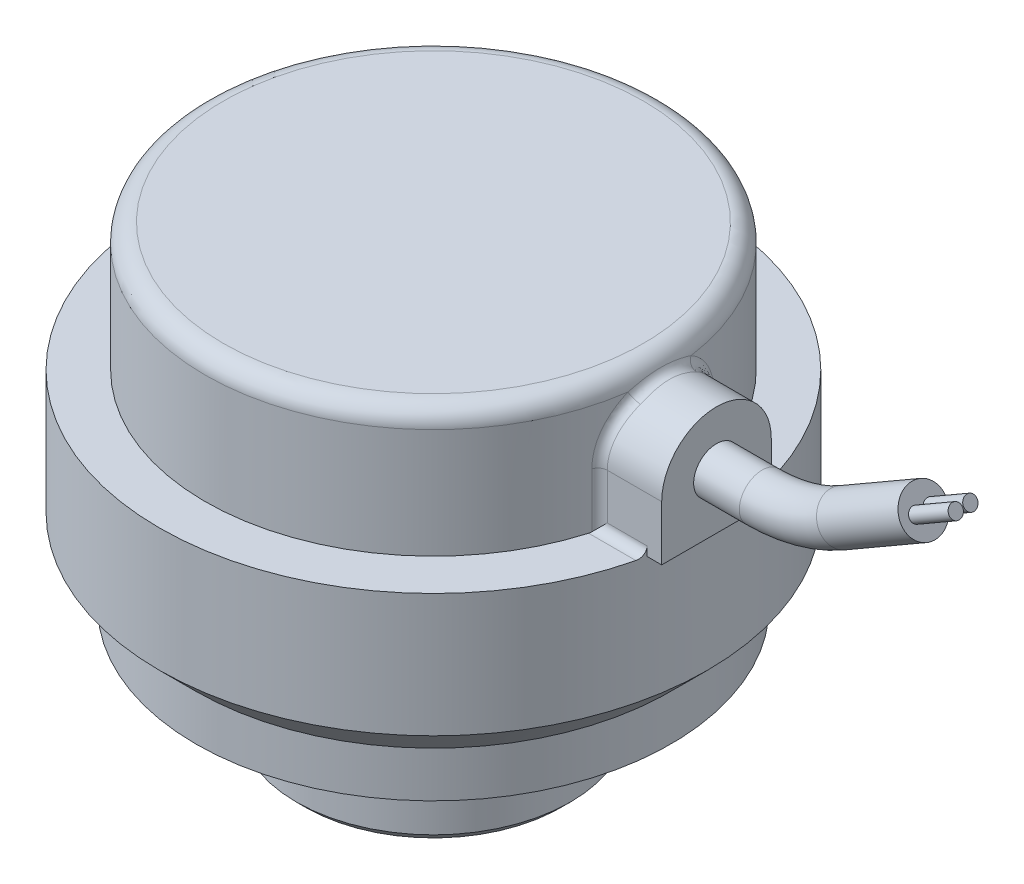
ISO-10303-21;
HEADER;
FILE_DESCRIPTION(('STEP AP214'),'2;1');
FILE_NAME('part.step','',(''),(''),'','','');
FILE_SCHEMA(('AUTOMOTIVE_DESIGN { 1 0 10303 214 1 1 1 1 }'));
ENDSEC;
DATA;
#1=APPLICATION_CONTEXT('core data for automotive mechanical design processes');
#2=APPLICATION_PROTOCOL_DEFINITION('international standard','automotive_design',2000,#1);
#3=PRODUCT_CONTEXT('',#1,'mechanical');
#4=PRODUCT('Part','Part','',(#3));
#5=PRODUCT_RELATED_PRODUCT_CATEGORY('part','',(#4));
#6=PRODUCT_DEFINITION_FORMATION('','',#4);
#7=PRODUCT_DEFINITION_CONTEXT('part definition',#1,'design');
#8=PRODUCT_DEFINITION('design','',#6,#7);
#9=PRODUCT_DEFINITION_SHAPE('','',#8);
#10=(LENGTH_UNIT() NAMED_UNIT(*) SI_UNIT(.MILLI.,.METRE.));
#11=(NAMED_UNIT(*) PLANE_ANGLE_UNIT() SI_UNIT($,.RADIAN.));
#12=(NAMED_UNIT(*) SI_UNIT($,.STERADIAN.) SOLID_ANGLE_UNIT());
#13=UNCERTAINTY_MEASURE_WITH_UNIT(LENGTH_MEASURE(1.E-05),#10,'distance_accuracy_value','');
#14=(GEOMETRIC_REPRESENTATION_CONTEXT(3) GLOBAL_UNCERTAINTY_ASSIGNED_CONTEXT((#13)) GLOBAL_UNIT_ASSIGNED_CONTEXT((#10,
#11,#12)) REPRESENTATION_CONTEXT('',''));
#15=CARTESIAN_POINT('',(0.,0.,0.));
#16=DIRECTION('',(0.,0.,1.));
#17=DIRECTION('',(1.,0.,0.));
#18=AXIS2_PLACEMENT_3D('',#15,#16,#17);
#19=CARTESIAN_POINT('',(53.6725294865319,47.9959802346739,0.));
#20=DIRECTION('',(0.866025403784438,0.500000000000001,0.));
#21=DIRECTION('',(0.,0.,-1.));
#22=AXIS2_PLACEMENT_3D('',#19,#20,#21);
#23=PLANE('',#22);
#24=CARTESIAN_POINT('',(53.6725294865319,47.9959802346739,0.8));
#25=DIRECTION('',(0.866025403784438,0.500000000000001,0.));
#26=DIRECTION('',(-0.500000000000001,0.866025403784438,0.));
#27=AXIS2_PLACEMENT_3D('',#24,#25,#26);
#28=CIRCLE('',#27,0.750000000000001);
#29=CARTESIAN_POINT('',(53.2975294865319,48.6454992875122,0.8));
#30=VERTEX_POINT('',#29);
#31=EDGE_CURVE('E448',#30,#30,#28,.T.);
#32=ORIENTED_EDGE('',*,*,#31,.F.);
#33=EDGE_LOOP('',(#32));
#34=FACE_BOUND('',#33,.T.);
#35=CARTESIAN_POINT('',(53.6725294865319,47.9959802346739,0.));
#36=DIRECTION('',(0.866025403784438,0.500000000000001,0.));
#37=DIRECTION('',(0.,0.,-1.));
#38=AXIS2_PLACEMENT_3D('',#35,#36,#37);
#39=CIRCLE('',#38,2.5);
#40=CARTESIAN_POINT('',(53.6725294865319,47.9959802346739,-2.5));
#41=VERTEX_POINT('',#40);
#42=EDGE_CURVE('E158',#41,#41,#39,.T.);
#43=ORIENTED_EDGE('',*,*,#42,.T.);
#44=EDGE_LOOP('',(#43));
#45=FACE_BOUND('',#44,.T.);
#46=CARTESIAN_POINT('',(53.6725294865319,47.9959802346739,-0.8));
#47=DIRECTION('',(0.866025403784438,0.500000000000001,0.));
#48=DIRECTION('',(-0.500000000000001,0.866025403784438,0.));
#49=AXIS2_PLACEMENT_3D('',#46,#47,#48);
#50=CIRCLE('',#49,0.750000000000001);
#51=CARTESIAN_POINT('',(53.2975294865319,48.6454992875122,-0.8));
#52=VERTEX_POINT('',#51);
#53=EDGE_CURVE('E449',#52,#52,#50,.T.);
#54=ORIENTED_EDGE('',*,*,#53,.F.);
#55=EDGE_LOOP('',(#54));
#56=FACE_BOUND('',#55,.T.);
#57=ADVANCED_FACE('F33',(#34,#45,#56),#23,.T.);
#58=CARTESIAN_POINT('',(31.,40.5,0.));
#59=DIRECTION('',(1.,0.,0.));
#60=DIRECTION('',(0.,0.,-1.));
#61=AXIS2_PLACEMENT_3D('',#58,#59,#60);
#62=PLANE('',#61);
#63=CARTESIAN_POINT('',(31.,40.5,0.));
#64=DIRECTION('',(1.,0.,0.));
#65=DIRECTION('',(0.,0.,-1.));
#66=AXIS2_PLACEMENT_3D('',#63,#64,#65);
#67=CIRCLE('',#66,6.);
#68=CARTESIAN_POINT('',(31.,40.5,-6.));
#69=VERTEX_POINT('',#68);
#70=CARTESIAN_POINT('',(31.,40.5,6.));
#71=VERTEX_POINT('',#70);
#72=EDGE_CURVE('E134',#69,#71,#67,.T.);
#73=ORIENTED_EDGE('',*,*,#72,.T.);
#74=DIRECTION('',(0.,-1.,0.));
#75=VECTOR('',#74,1.);
#76=CARTESIAN_POINT('',(31.,34.5,6.));
#77=LINE('',#76,#75);
#78=CARTESIAN_POINT('',(31.,34.5,6.));
#79=VERTEX_POINT('',#78);
#80=EDGE_CURVE('E144',#71,#79,#77,.T.);
#81=ORIENTED_EDGE('',*,*,#80,.T.);
#82=DIRECTION('',(0.,0.,-1.));
#83=VECTOR('',#82,1.);
#84=CARTESIAN_POINT('',(31.,34.5,-6.));
#85=LINE('',#84,#83);
#86=CARTESIAN_POINT('',(31.,34.5,-6.));
#87=VERTEX_POINT('',#86);
#88=EDGE_CURVE('E150',#79,#87,#85,.T.);
#89=ORIENTED_EDGE('',*,*,#88,.T.);
#90=DIRECTION('',(0.,1.,0.));
#91=VECTOR('',#90,1.);
#92=CARTESIAN_POINT('',(31.,40.5,-6.));
#93=LINE('',#92,#91);
#94=EDGE_CURVE('E129',#87,#69,#93,.T.);
#95=ORIENTED_EDGE('',*,*,#94,.T.);
#96=EDGE_LOOP('',(#73,#81,#89,#95));
#97=FACE_BOUND('',#96,.T.);
#98=CARTESIAN_POINT('',(31.,40.5,0.));
#99=DIRECTION('',(1.,0.,0.));
#100=DIRECTION('',(0.,0.,-1.));
#101=AXIS2_PLACEMENT_3D('',#98,#99,#100);
#102=CIRCLE('',#101,2.5);
#103=CARTESIAN_POINT('',(31.,40.5,-2.5));
#104=VERTEX_POINT('',#103);
#105=EDGE_CURVE('E37',#104,#104,#102,.F.);
#106=ORIENTED_EDGE('',*,*,#105,.T.);
#107=EDGE_LOOP('',(#106));
#108=FACE_BOUND('',#107,.T.);
#109=ADVANCED_FACE('F147',(#97,#108),#62,.T.);
#110=CARTESIAN_POINT('',(0.,34.,0.));
#111=DIRECTION('',(0.,-1.,0.));
#112=DIRECTION('',(0.,0.,-1.));
#113=AXIS2_PLACEMENT_3D('',#110,#111,#112);
#114=CONICAL_SURFACE('',#113,5.,1.0471975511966);
#115=CARTESIAN_POINT('',(0.,36.8867513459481,0.));
#116=VERTEX_POINT('',#115);
#117=VERTEX_LOOP('',#116);
#118=FACE_BOUND('',#117,.T.);
#119=CARTESIAN_POINT('',(0.,34.,0.));
#120=DIRECTION('',(0.,1.,0.));
#121=DIRECTION('',(0.,0.,1.));
#122=AXIS2_PLACEMENT_3D('',#119,#120,#121);
#123=CIRCLE('',#122,5.);
#124=CARTESIAN_POINT('',(0.,34.,5.));
#125=VERTEX_POINT('',#124);
#126=EDGE_CURVE('E191',#125,#125,#123,.T.);
#127=ORIENTED_EDGE('',*,*,#126,.F.);
#128=EDGE_LOOP('',(#127));
#129=FACE_BOUND('',#128,.T.);
#130=ADVANCED_FACE('F266',(#118,#129),#114,.F.);
#131=CARTESIAN_POINT('',(0.,0.,0.));
#132=DIRECTION('',(0.,1.,0.));
#133=DIRECTION('',(0.,0.,1.));
#134=AXIS2_PLACEMENT_3D('',#131,#132,#133);
#135=CYLINDRICAL_SURFACE('',#134,5.);
#136=ORIENTED_EDGE('',*,*,#126,.T.);
#137=EDGE_LOOP('',(#136));
#138=FACE_BOUND('',#137,.T.);
#139=CARTESIAN_POINT('',(0.,0.,0.));
#140=DIRECTION('',(0.,1.,0.));
#141=DIRECTION('',(0.,0.,1.));
#142=AXIS2_PLACEMENT_3D('',#139,#140,#141);
#143=CIRCLE('',#142,5.);
#144=CARTESIAN_POINT('',(0.,0.,5.));
#145=VERTEX_POINT('',#144);
#146=EDGE_CURVE('E188',#145,#145,#143,.T.);
#147=ORIENTED_EDGE('',*,*,#146,.F.);
#148=EDGE_LOOP('',(#147));
#149=FACE_BOUND('',#148,.T.);
#150=ADVANCED_FACE('F262',(#138,#149),#135,.F.);
#151=CARTESIAN_POINT('',(-15.,0.,0.));
#152=DIRECTION('',(0.,-1.,0.));
#153=DIRECTION('',(0.,0.,-1.));
#154=AXIS2_PLACEMENT_3D('',#151,#152,#153);
#155=PLANE('',#154);
#156=CARTESIAN_POINT('',(0.,0.,0.));
#157=DIRECTION('',(0.,-1.,0.));
#158=DIRECTION('',(0.,0.,-1.));
#159=AXIS2_PLACEMENT_3D('',#156,#157,#158);
#160=CIRCLE('',#159,14.);
#161=CARTESIAN_POINT('',(0.,0.,-14.));
#162=VERTEX_POINT('',#161);
#163=EDGE_CURVE('E11',#162,#162,#160,.T.);
#164=ORIENTED_EDGE('',*,*,#163,.T.);
#165=EDGE_LOOP('',(#164));
#166=FACE_BOUND('',#165,.T.);
#167=ORIENTED_EDGE('',*,*,#146,.T.);
#168=EDGE_LOOP('',(#167));
#169=FACE_BOUND('',#168,.T.);
#170=ADVANCED_FACE('F258',(#166,#169),#155,.T.);
#171=CARTESIAN_POINT('',(0.,0.,0.));
#172=DIRECTION('',(0.,1.,0.));
#173=DIRECTION('',(0.,0.,1.));
#174=AXIS2_PLACEMENT_3D('',#171,#172,#173);
#175=CYLINDRICAL_SURFACE('',#174,15.);
#176=CARTESIAN_POINT('',(0.,1.,0.));
#177=DIRECTION('',(0.,-1.,0.));
#178=DIRECTION('',(0.,0.,-1.));
#179=AXIS2_PLACEMENT_3D('',#176,#177,#178);
#180=CIRCLE('',#179,15.);
#181=CARTESIAN_POINT('',(0.,1.,-15.));
#182=VERTEX_POINT('',#181);
#183=EDGE_CURVE('E42',#182,#182,#180,.F.);
#184=ORIENTED_EDGE('',*,*,#183,.T.);
#185=EDGE_LOOP('',(#184));
#186=FACE_BOUND('',#185,.T.);
#187=CARTESIAN_POINT('',(0.,12.,0.));
#188=DIRECTION('',(0.,1.,0.));
#189=DIRECTION('',(0.,0.,1.));
#190=AXIS2_PLACEMENT_3D('',#187,#188,#189);
#191=CIRCLE('',#190,15.);
#192=CARTESIAN_POINT('',(0.,12.,15.));
#193=VERTEX_POINT('',#192);
#194=EDGE_CURVE('E185',#193,#193,#191,.T.);
#195=ORIENTED_EDGE('',*,*,#194,.F.);
#196=EDGE_LOOP('',(#195));
#197=FACE_BOUND('',#196,.T.);
#198=ADVANCED_FACE('F254',(#186,#197),#175,.T.);
#199=CARTESIAN_POINT('',(-26.,12.,0.));
#200=DIRECTION('',(0.,-1.,0.));
#201=DIRECTION('',(0.,0.,-1.));
#202=AXIS2_PLACEMENT_3D('',#199,#200,#201);
#203=PLANE('',#202);
#204=ORIENTED_EDGE('',*,*,#194,.T.);
#205=EDGE_LOOP('',(#204));
#206=FACE_BOUND('',#205,.T.);
#207=CARTESIAN_POINT('',(0.,12.,0.));
#208=DIRECTION('',(0.,1.,0.));
#209=DIRECTION('',(0.,0.,1.));
#210=AXIS2_PLACEMENT_3D('',#207,#208,#209);
#211=CIRCLE('',#210,26.);
#212=CARTESIAN_POINT('',(0.,12.,26.));
#213=VERTEX_POINT('',#212);
#214=EDGE_CURVE('E182',#213,#213,#211,.T.);
#215=ORIENTED_EDGE('',*,*,#214,.F.);
#216=EDGE_LOOP('',(#215));
#217=FACE_BOUND('',#216,.T.);
#218=ADVANCED_FACE('F250',(#206,#217),#203,.T.);
#219=CARTESIAN_POINT('',(0.,0.,0.));
#220=DIRECTION('',(0.,1.,0.));
#221=DIRECTION('',(0.,0.,1.));
#222=AXIS2_PLACEMENT_3D('',#219,#220,#221);
#223=CYLINDRICAL_SURFACE('',#222,26.);
#224=ORIENTED_EDGE('',*,*,#214,.T.);
#225=EDGE_LOOP('',(#224));
#226=FACE_BOUND('',#225,.T.);
#227=CARTESIAN_POINT('',(0.,17.0000000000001,0.));
#228=DIRECTION('',(0.,1.,0.));
#229=DIRECTION('',(0.,0.,1.));
#230=AXIS2_PLACEMENT_3D('',#227,#228,#229);
#231=CIRCLE('',#230,26.);
#232=CARTESIAN_POINT('',(0.,17.0000000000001,26.));
#233=VERTEX_POINT('',#232);
#234=EDGE_CURVE('E179',#233,#233,#231,.T.);
#235=ORIENTED_EDGE('',*,*,#234,.F.);
#236=EDGE_LOOP('',(#235));
#237=FACE_BOUND('',#236,.T.);
#238=ADVANCED_FACE('F246',(#226,#237),#223,.T.);
#239=CARTESIAN_POINT('',(0.,21.,0.));
#240=DIRECTION('',(0.,1.,0.));
#241=DIRECTION('',(0.,0.,1.));
#242=AXIS2_PLACEMENT_3D('',#239,#240,#241);
#243=CONICAL_SURFACE('',#242,30.,0.785398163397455);
#244=ORIENTED_EDGE('',*,*,#234,.T.);
#245=EDGE_LOOP('',(#244));
#246=FACE_BOUND('',#245,.T.);
#247=CARTESIAN_POINT('',(0.,21.,0.));
#248=DIRECTION('',(0.,1.,0.));
#249=DIRECTION('',(0.,0.,1.));
#250=AXIS2_PLACEMENT_3D('',#247,#248,#249);
#251=CIRCLE('',#250,30.);
#252=CARTESIAN_POINT('',(0.,21.,30.));
#253=VERTEX_POINT('',#252);
#254=EDGE_CURVE('E176',#253,#253,#251,.T.);
#255=ORIENTED_EDGE('',*,*,#254,.F.);
#256=EDGE_LOOP('',(#255));
#257=FACE_BOUND('',#256,.T.);
#258=ADVANCED_FACE('F241',(#246,#257),#243,.T.);
#259=CARTESIAN_POINT('',(0.,0.,0.));
#260=DIRECTION('',(0.,1.,0.));
#261=DIRECTION('',(0.,0.,1.));
#262=AXIS2_PLACEMENT_3D('',#259,#260,#261);
#263=CYLINDRICAL_SURFACE('',#262,30.);
#264=ORIENTED_EDGE('',*,*,#254,.T.);
#265=EDGE_LOOP('',(#264));
#266=FACE_BOUND('',#265,.T.);
#267=CARTESIAN_POINT('',(0.,34.5,0.));
#268=DIRECTION('',(0.,1.,0.));
#269=DIRECTION('',(0.,0.,1.));
#270=AXIS2_PLACEMENT_3D('',#267,#268,#269);
#271=CIRCLE('',#270,30.);
#272=CARTESIAN_POINT('',(29.3938769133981,34.5,6.));
#273=VERTEX_POINT('',#272);
#274=CARTESIAN_POINT('',(29.3938769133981,34.5,-6.));
#275=VERTEX_POINT('',#274);
#276=EDGE_CURVE('E173',#273,#275,#271,.T.);
#277=ORIENTED_EDGE('',*,*,#276,.F.);
#278=DIRECTION('',(0.,1.,0.));
#279=VECTOR('',#278,1.);
#280=CARTESIAN_POINT('',(29.3938769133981,35.5,6.));
#281=LINE('',#280,#279);
#282=CARTESIAN_POINT('',(29.3938769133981,35.5,6.));
#283=VERTEX_POINT('',#282);
#284=EDGE_CURVE('E55',#283,#273,#281,.F.);
#285=ORIENTED_EDGE('',*,*,#284,.F.);
#286=CARTESIAN_POINT('',(29.3938769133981,35.5,6.));
#287=CARTESIAN_POINT('',(29.3938767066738,35.4722984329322,5.99999989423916));
#288=CARTESIAN_POINT('',(29.3936418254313,35.4446102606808,6.00115181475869));
#289=CARTESIAN_POINT('',(29.3927037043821,35.3894347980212,6.00574533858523));
#290=CARTESIAN_POINT('',(29.3920005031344,35.3619474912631,6.00918675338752));
#291=CARTESIAN_POINT('',(29.389193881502,35.2801586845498,6.02290425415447));
#292=CARTESIAN_POINT('',(29.3863934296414,35.2264095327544,6.03657374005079));
#293=CARTESIAN_POINT('',(29.3789828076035,35.1220256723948,6.07253670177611));
#294=CARTESIAN_POINT('',(29.374372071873,35.0713919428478,6.09483287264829));
#295=CARTESIAN_POINT('',(29.3634256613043,34.9746217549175,6.14735310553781));
#296=CARTESIAN_POINT('',(29.3570900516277,34.9284851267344,6.1775768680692));
#297=CARTESIAN_POINT('',(29.3427584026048,34.8416071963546,6.24529685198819));
#298=CARTESIAN_POINT('',(29.3347497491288,34.8009109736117,6.28284816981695));
#299=CARTESIAN_POINT('',(29.3172616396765,34.7263871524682,6.36395221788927));
#300=CARTESIAN_POINT('',(29.3077818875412,34.6925609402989,6.40750615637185));
#301=CARTESIAN_POINT('',(29.2873527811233,34.63202667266,6.50025096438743));
#302=CARTESIAN_POINT('',(29.2763783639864,34.6054703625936,6.54953522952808));
#303=CARTESIAN_POINT('',(29.2533533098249,34.5609954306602,6.65162040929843));
#304=CARTESIAN_POINT('',(29.2413028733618,34.5430752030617,6.70442066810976));
#305=CARTESIAN_POINT('',(29.219704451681,34.5197978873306,6.79783229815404));
#306=CARTESIAN_POINT('',(29.210335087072,34.5123735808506,6.83798400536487));
#307=CARTESIAN_POINT('',(29.1913085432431,34.5024748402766,6.91876056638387));
#308=CARTESIAN_POINT('',(29.1816518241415,34.4999928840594,6.9593846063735));
#309=CARTESIAN_POINT('',(29.1719042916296,34.5,7.));
#310=B_SPLINE_CURVE_WITH_KNOTS('',3,(#286,#287,#288,#289,#290,#291,#292,#293,#294,#295,#296,
#297,#298,#299,#300,#301,#302,#303,#304,#305,#306,#307,#308,#309),.UNSPECIFIED.,.F.,.F.,(4,2,2,
2,2,2,2,2,2,2,2,4),(0.,0.0830532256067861,0.166099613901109,0.331834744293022,0.497621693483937,
0.663402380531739,0.830481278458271,0.997593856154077,1.16796669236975,1.33830783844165,
1.46370538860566,1.58891194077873),.UNSPECIFIED.);
#311=CARTESIAN_POINT('',(29.1719042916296,34.5,7.));
#312=VERTEX_POINT('',#311);
#313=EDGE_CURVE('E221',#283,#312,#310,.T.);
#314=ORIENTED_EDGE('',*,*,#313,.T.);
#315=CARTESIAN_POINT('',(29.1719042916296,34.5,-7.));
#316=VERTEX_POINT('',#315);
#317=EDGE_CURVE('E172',#316,#312,#271,.T.);
#318=ORIENTED_EDGE('',*,*,#317,.F.);
#319=CARTESIAN_POINT('',(29.1719042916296,34.5,-7.));
#320=CARTESIAN_POINT('',(29.1856165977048,34.4999559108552,-6.94288378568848));
#321=CARTESIAN_POINT('',(29.1991486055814,34.504891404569,-6.88572308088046));
#322=CARTESIAN_POINT('',(29.2255181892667,34.5244564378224,-6.7729119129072));
#323=CARTESIAN_POINT('',(29.2383556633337,34.5390873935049,-6.7172616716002));
#324=CARTESIAN_POINT('',(29.2630093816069,34.5777957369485,-6.60903893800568));
#325=CARTESIAN_POINT('',(29.2748246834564,34.60188173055,-6.55646929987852));
#326=CARTESIAN_POINT('',(29.2971284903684,34.6588854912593,-6.45607470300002));
#327=CARTESIAN_POINT('',(29.3076176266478,34.691799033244,-6.40824748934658));
#328=CARTESIAN_POINT('',(29.3268755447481,34.7650095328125,-6.31952571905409));
#329=CARTESIAN_POINT('',(29.3356688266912,34.8051819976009,-6.27853381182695));
#330=CARTESIAN_POINT('',(29.351547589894,34.8921556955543,-6.20387898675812));
#331=CARTESIAN_POINT('',(29.358632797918,34.9389579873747,-6.17021724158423));
#332=CARTESIAN_POINT('',(29.3708023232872,35.0366853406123,-6.11202402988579));
#333=CARTESIAN_POINT('',(29.3759288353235,35.0874911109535,-6.08730072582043));
#334=CARTESIAN_POINT('',(29.3843052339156,35.1926561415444,-6.04673785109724));
#335=CARTESIAN_POINT('',(29.3875567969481,35.2470121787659,-6.03089034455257));
#336=CARTESIAN_POINT('',(29.3911854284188,35.3348363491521,-6.01317404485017));
#337=CARTESIAN_POINT('',(29.392194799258,35.3676905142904,-6.00823630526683));
#338=CARTESIAN_POINT('',(29.3935400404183,35.4336912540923,-6.0016504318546));
#339=CARTESIAN_POINT('',(29.3938769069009,35.4668373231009,-5.99999743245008));
#340=CARTESIAN_POINT('',(29.3938769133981,35.5,-6.));
#341=B_SPLINE_CURVE_WITH_KNOTS('',3,(#319,#320,#321,#322,#323,#324,#325,#326,#327,#328,#329,
#330,#331,#332,#333,#334,#335,#336,#337,#338,#339,#340),.UNSPECIFIED.,.F.,.F.,(4,2,2,2,2,2,2,2,
2,2,4),(0.,0.176013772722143,0.352053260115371,0.528253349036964,0.704369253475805,
0.877710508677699,1.05107947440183,1.22046899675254,1.38970682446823,1.48926703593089,
1.58867966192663),.UNSPECIFIED.);
#342=CARTESIAN_POINT('',(29.3938769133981,35.5,-6.));
#343=VERTEX_POINT('',#342);
#344=EDGE_CURVE('E228',#316,#343,#341,.T.);
#345=ORIENTED_EDGE('',*,*,#344,.T.);
#346=DIRECTION('',(0.,1.,0.));
#347=VECTOR('',#346,1.);
#348=CARTESIAN_POINT('',(29.3938769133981,34.5,-6.));
#349=LINE('',#348,#347);
#350=EDGE_CURVE('E49',#275,#343,#349,.T.);
#351=ORIENTED_EDGE('',*,*,#350,.F.);
#352=EDGE_LOOP('',(#277,#285,#314,#318,#345,#351));
#353=FACE_BOUND('',#352,.T.);
#354=ADVANCED_FACE('F236',(#266,#353),#263,.T.);
#355=CARTESIAN_POINT('',(-25.,34.5,0.));
#356=DIRECTION('',(0.,1.,0.));
#357=DIRECTION('',(0.,0.,1.));
#358=AXIS2_PLACEMENT_3D('',#355,#356,#357);
#359=PLANE('',#358);
#360=CARTESIAN_POINT('',(0.,34.5,0.));
#361=DIRECTION('',(0.,1.,0.));
#362=DIRECTION('',(0.,0.,1.));
#363=AXIS2_PLACEMENT_3D('',#360,#361,#362);
#364=CIRCLE('',#363,25.);
#365=CARTESIAN_POINT('',(24.,34.5,-7.));
#366=VERTEX_POINT('',#365);
#367=CARTESIAN_POINT('',(24.,34.5,7.));
#368=VERTEX_POINT('',#367);
#369=EDGE_CURVE('E169',#366,#368,#364,.T.);
#370=ORIENTED_EDGE('',*,*,#369,.F.);
#371=DIRECTION('',(1.,0.,0.));
#372=VECTOR('',#371,1.);
#373=CARTESIAN_POINT('',(29.3938769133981,34.5,-7.));
#374=LINE('',#373,#372);
#375=EDGE_CURVE('E569',#366,#316,#374,.T.);
#376=ORIENTED_EDGE('',*,*,#375,.T.);
#377=ORIENTED_EDGE('',*,*,#317,.T.);
#378=DIRECTION('',(1.,0.,0.));
#379=VECTOR('',#378,1.);
#380=CARTESIAN_POINT('',(24.2693221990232,34.5,7.));
#381=LINE('',#380,#379);
#382=EDGE_CURVE('E510',#312,#368,#381,.F.);
#383=ORIENTED_EDGE('',*,*,#382,.T.);
#384=EDGE_LOOP('',(#370,#376,#377,#383));
#385=FACE_BOUND('',#384,.T.);
#386=ADVANCED_FACE('F240',(#385),#359,.T.);
#387=CARTESIAN_POINT('',(0.,0.,0.));
#388=DIRECTION('',(0.,1.,0.));
#389=DIRECTION('',(0.,0.,1.));
#390=AXIS2_PLACEMENT_3D('',#387,#388,#389);
#391=CYLINDRICAL_SURFACE('',#390,25.);
#392=CARTESIAN_POINT('',(0.,46.5,0.));
#393=DIRECTION('',(0.,1.,0.));
#394=DIRECTION('',(0.,0.,1.));
#395=AXIS2_PLACEMENT_3D('',#392,#393,#394);
#396=CIRCLE('',#395,25.);
#397=CARTESIAN_POINT('',(24.7584484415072,46.5,-3.46687622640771));
#398=VERTEX_POINT('',#397);
#399=CARTESIAN_POINT('',(24.7584484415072,46.5,3.46687622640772));
#400=VERTEX_POINT('',#399);
#401=EDGE_CURVE('E154',#398,#400,#396,.T.);
#402=ORIENTED_EDGE('',*,*,#401,.F.);
#403=CARTESIAN_POINT('',(25.142557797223,38.5551708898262,-5.67605846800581));
#404=CARTESIAN_POINT('',(24.3632949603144,38.4922356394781,-5.65449450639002));
#405=CARTESIAN_POINT('',(24.1755363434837,38.2310327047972,-6.36737328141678));
#406=CARTESIAN_POINT('',(25.1261287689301,38.7110295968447,-5.72948011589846));
#407=CARTESIAN_POINT('',(24.3502453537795,38.6518654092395,-5.71116697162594));
#408=CARTESIAN_POINT('',(24.1597392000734,38.4128678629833,-6.42730141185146));
#409=CARTESIAN_POINT('',(25.1114488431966,38.8692229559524,-5.77649057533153));
#410=CARTESIAN_POINT('',(24.3385215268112,38.8146448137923,-5.7612477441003));
#411=CARTESIAN_POINT('',(24.1456238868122,38.5974267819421,-6.48003750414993));
#412=CARTESIAN_POINT('',(25.0859397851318,39.1891625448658,-5.85737826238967));
#413=CARTESIAN_POINT('',(24.3181231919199,39.1442687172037,-5.84746565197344));
#414=CARTESIAN_POINT('',(24.1210959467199,38.9706896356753,-6.57077689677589));
#415=CARTESIAN_POINT('',(25.0751108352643,39.3509089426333,-5.89125486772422));
#416=CARTESIAN_POINT('',(24.3094314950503,39.3112441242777,-5.88367834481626));
#417=CARTESIAN_POINT('',(24.1106834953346,39.1593937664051,-6.60877949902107));
#418=CARTESIAN_POINT('',(25.0576687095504,39.676622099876,-5.94552536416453));
#419=CARTESIAN_POINT('',(24.2954294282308,39.647725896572,-5.94167511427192));
#420=CARTESIAN_POINT('',(24.0939122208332,39.5393924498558,-6.6696598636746));
#421=CARTESIAN_POINT('',(25.0510503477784,39.8405858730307,-5.96593584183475));
#422=CARTESIAN_POINT('',(24.2901020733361,39.8173782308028,-5.96353086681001));
#423=CARTESIAN_POINT('',(24.0875484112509,39.7306835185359,-6.6925562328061));
#424=CARTESIAN_POINT('',(25.0421960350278,40.1696708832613,-5.99317818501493));
#425=CARTESIAN_POINT('',(24.28297696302,40.1579117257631,-5.99268881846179));
#426=CARTESIAN_POINT('',(24.0790346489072,40.1146160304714,-6.72311655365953));
#427=CARTESIAN_POINT('',(25.0399598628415,40.3347920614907,-6.00001073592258));
#428=CARTESIAN_POINT('',(24.2811722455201,40.3289538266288,-6.00001961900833));
#429=CARTESIAN_POINT('',(24.0768844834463,40.3072574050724,-6.73078127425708));
#430=CARTESIAN_POINT('',(25.0399844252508,40.8303682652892,-5.99997853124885));
#431=CARTESIAN_POINT('',(24.2811989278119,40.8420438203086,-5.99996076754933));
#432=CARTESIAN_POINT('',(24.0769081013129,40.8854296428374,-6.73074514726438));
#433=CARTESIAN_POINT('',(25.0489756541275,41.161083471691,-5.97259180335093));
#434=CARTESIAN_POINT('',(24.2884744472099,41.1851017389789,-5.9705066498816));
#435=CARTESIAN_POINT('',(24.0855535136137,41.2712640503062,-6.70002285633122));
#436=CARTESIAN_POINT('',(25.0838673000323,41.8125691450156,-5.86399111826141));
#437=CARTESIAN_POINT('',(24.3164773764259,41.858112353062,-5.85447019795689));
#438=CARTESIAN_POINT('',(24.1191031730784,42.0313306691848,-6.57819516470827));
#439=CARTESIAN_POINT('',(25.1097636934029,42.1333419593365,-5.78278996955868));
#440=CARTESIAN_POINT('',(24.3373052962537,42.1892741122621,-5.7674664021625));
#441=CARTESIAN_POINT('',(24.144003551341,42.4055656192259,-6.48710413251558));
#442=CARTESIAN_POINT('',(25.1753078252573,42.755897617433,-5.56947041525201));
#443=CARTESIAN_POINT('',(24.3894397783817,42.8281559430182,-5.54084818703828));
#444=CARTESIAN_POINT('',(24.207026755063,43.1318805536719,-6.24780335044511));
#445=CARTESIAN_POINT('',(25.2149370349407,43.0577054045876,-5.43742058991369));
#446=CARTESIAN_POINT('',(24.4208929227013,43.1367623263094,-5.40055428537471));
#447=CARTESIAN_POINT('',(24.2451317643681,43.4839896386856,-6.0996705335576));
#448=CARTESIAN_POINT('',(25.3034816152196,43.6350799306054,-5.12630012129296));
#449=CARTESIAN_POINT('',(24.490272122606,43.7227868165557,-5.07323897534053));
#450=CARTESIAN_POINT('',(24.330270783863,44.1575932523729,-5.75065718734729));
#451=CARTESIAN_POINT('',(25.352403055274,43.9106293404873,-4.94719871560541));
#452=CARTESIAN_POINT('',(24.5283506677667,44.0005529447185,-4.88532091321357));
#453=CARTESIAN_POINT('',(24.377310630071,44.4790675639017,-5.54974214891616));
#454=CARTESIAN_POINT('',(25.4611157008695,44.4635555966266,-4.51976201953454));
#455=CARTESIAN_POINT('',(24.6118290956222,44.5536273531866,-4.44135209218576));
#456=CARTESIAN_POINT('',(24.481842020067,45.1241481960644,-5.07024585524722));
#457=CARTESIAN_POINT('',(25.5214829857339,44.7361651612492,-4.26534655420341));
#458=CARTESIAN_POINT('',(24.6575485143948,44.8228466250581,-4.17890105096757));
#459=CARTESIAN_POINT('',(24.5398874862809,45.4421926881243,-4.78484389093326));
#460=CARTESIAN_POINT('',(25.6392759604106,45.2300266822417,-3.71007844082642));
#461=CARTESIAN_POINT('',(24.7452759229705,45.3057454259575,-3.61378471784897));
#462=CARTESIAN_POINT('',(24.6531499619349,46.0183644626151,-4.16194696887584));
#463=CARTESIAN_POINT('',(25.6967018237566,45.4512816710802,-3.40922853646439));
#464=CARTESIAN_POINT('',(24.787215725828,45.5185244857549,-3.31059960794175));
#465=CARTESIAN_POINT('',(24.7083671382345,46.2764952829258,-3.82445508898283));
#466=CARTESIAN_POINT('',(25.771821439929,45.7275838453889,-2.94949859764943));
#467=CARTESIAN_POINT('',(24.8411114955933,45.7810583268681,-2.85458472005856));
#468=CARTESIAN_POINT('',(24.7805975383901,46.5988478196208,-3.30873240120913));
#469=CARTESIAN_POINT('',(25.7938117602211,45.8065053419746,-2.80502230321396));
#470=CARTESIAN_POINT('',(24.8568050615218,45.8558104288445,-2.71148757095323));
#471=CARTESIAN_POINT('',(24.8017420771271,46.6909228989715,-3.14665963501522));
#472=CARTESIAN_POINT('',(25.8351710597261,45.9523232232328,-2.50982557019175));
#473=CARTESIAN_POINT('',(24.8861416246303,45.9933523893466,-2.42046187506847));
#474=CARTESIAN_POINT('',(24.8415106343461,46.861043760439,-2.81550945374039));
#475=CARTESIAN_POINT('',(25.8545404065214,46.0192212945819,-2.35910601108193));
#476=CARTESIAN_POINT('',(24.899763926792,46.0560323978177,-2.27260116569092));
#477=CARTESIAN_POINT('',(24.8601350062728,46.9390915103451,-2.64643302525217));
#478=CARTESIAN_POINT('',(25.8901358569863,46.1404864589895,-2.0523475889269));
#479=CARTESIAN_POINT('',(24.9246642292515,46.1692506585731,-1.97293343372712));
#480=CARTESIAN_POINT('',(24.8943614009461,47.0805675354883,-2.30231300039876));
#481=CARTESIAN_POINT('',(25.9063600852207,46.1948460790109,-1.89630561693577));
#482=CARTESIAN_POINT('',(24.935918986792,46.2196750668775,-1.82122907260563));
#483=CARTESIAN_POINT('',(24.9099616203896,47.1439870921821,-2.12726591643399));
#484=CARTESIAN_POINT('',(25.9352386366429,46.2905918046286,-1.58000228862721));
#485=CARTESIAN_POINT('',(24.9558677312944,46.3082361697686,-1.5147223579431));
#486=CARTESIAN_POINT('',(24.9377294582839,47.255690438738,-1.77243846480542));
#487=CARTESIAN_POINT('',(25.9478918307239,46.3319738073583,-1.41973961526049));
#488=CARTESIAN_POINT('',(24.964540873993,46.3462763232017,-1.36005539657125));
#489=CARTESIAN_POINT('',(24.9498959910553,47.3039694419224,-1.5926566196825));
#490=CARTESIAN_POINT('',(25.9585480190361,46.3666538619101,-1.25792387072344));
#491=CARTESIAN_POINT('',(24.971819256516,46.3780895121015,-1.20459075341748));
#492=CARTESIAN_POINT('',(24.9601423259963,47.3444295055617,-1.4111325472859));
#493=(BOUNDED_SURFACE() B_SPLINE_SURFACE(3,2,((#403,#404,#405),(#406,#407,#408),(#409,#410,
#411),(#412,#413,#414),(#415,#416,#417),(#418,#419,#420),(#421,#422,#423),(#424,#425,#426),
(#427,#428,#429),(#430,#431,#432),(#433,#434,#435),(#436,#437,#438),(#439,#440,#441),(#442,#443,
#444),(#445,#446,#447),(#448,#449,#450),(#451,#452,#453),(#454,#455,#456),(#457,#458,#459),
(#460,#461,#462),(#463,#464,#465),(#466,#467,#468),(#469,#470,#471),(#472,#473,#474),(#475,#476,
#477),(#478,#479,#480),(#481,#482,#483),(#484,#485,#486),(#487,#488,#489),(#490,#491,#492)),
.UNSPECIFIED.,.F.,.F.,.F.) B_SPLINE_SURFACE_WITH_KNOTS((4,2,2,2,2,2,2,2,2,2,2,2,2,2,4),(3,3),
(0.,0.57859189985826,1.15721121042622,1.73511648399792,2.31299258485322,3.46857824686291,
4.62388896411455,5.77764692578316,6.93216110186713,8.24240892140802,9.55257935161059,
10.132018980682,10.7113772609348,11.2910799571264,11.8709657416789),(0.,1.),
.UNSPECIFIED.) GEOMETRIC_REPRESENTATION_ITEM() RATIONAL_B_SPLINE_SURFACE(((1.,0.787700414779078,
1.),(1.,0.789140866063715,1.),(1.,0.790422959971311,1.),(1.,0.792645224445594,1.),(1.,
0.793585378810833,1.),(1.,0.795097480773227,1.),(1.,0.795669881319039,1.),(1.,0.796435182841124,
1.),(1.,0.796628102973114,1.),(1.,0.796626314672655,1.),(1.,0.795851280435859,1.),(1.,
0.792826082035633,1.),(1.,0.790576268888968,1.),(1.,0.784828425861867,1.),(1.,0.78133207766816,
1.),(1.,0.773427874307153,1.),(1.,0.769019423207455,1.),(1.,0.759093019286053,1.),(1.,
0.753505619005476,1.),(1.,0.742438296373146,1.),(1.,0.736958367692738,1.),(1.,0.729699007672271,
1.),(1.,0.727560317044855,1.),(1.,0.723517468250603,1.),(1.,0.721613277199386,1.),(1.,
0.718098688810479,1.),(1.,0.716488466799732,1.),(1.,0.713612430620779,1.),(1.,0.71234672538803,
1.),(1.,0.711278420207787,1.))) REPRESENTATION_ITEM('') SURFACE());
#494=CARTESIAN_POINT('',(24.9601423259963,47.3444295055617,-1.4111325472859));
#495=CARTESIAN_POINT('',(24.9498959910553,47.3039694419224,-1.5926566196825));
#496=CARTESIAN_POINT('',(24.937729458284,47.255690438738,-1.77243846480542));
#497=CARTESIAN_POINT('',(24.9099616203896,47.1439870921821,-2.12726591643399));
#498=CARTESIAN_POINT('',(24.8943614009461,47.0805675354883,-2.30231300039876));
#499=CARTESIAN_POINT('',(24.8601350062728,46.9390915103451,-2.64643302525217));
#500=CARTESIAN_POINT('',(24.8415106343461,46.861043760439,-2.81550945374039));
#501=CARTESIAN_POINT('',(24.8017420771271,46.6909228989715,-3.14665963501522));
#502=CARTESIAN_POINT('',(24.7805975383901,46.5988478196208,-3.30873240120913));
#503=CARTESIAN_POINT('',(24.7083671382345,46.2764952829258,-3.82445508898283));
#504=CARTESIAN_POINT('',(24.6531499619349,46.0183644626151,-4.16194696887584));
#505=CARTESIAN_POINT('',(24.5398874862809,45.4421926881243,-4.78484389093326));
#506=CARTESIAN_POINT('',(24.481842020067,45.1241481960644,-5.07024585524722));
#507=CARTESIAN_POINT('',(24.377310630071,44.4790675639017,-5.54974214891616));
#508=CARTESIAN_POINT('',(24.330270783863,44.1575932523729,-5.75065718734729));
#509=CARTESIAN_POINT('',(24.2451317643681,43.4839896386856,-6.0996705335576));
#510=CARTESIAN_POINT('',(24.207026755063,43.1318805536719,-6.24780335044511));
#511=CARTESIAN_POINT('',(24.144003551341,42.4055656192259,-6.48710413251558));
#512=CARTESIAN_POINT('',(24.1191031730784,42.0313306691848,-6.57819516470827));
#513=CARTESIAN_POINT('',(24.0855535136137,41.2712640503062,-6.70002285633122));
#514=CARTESIAN_POINT('',(24.0769081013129,40.8854296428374,-6.73074514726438));
#515=CARTESIAN_POINT('',(24.0768844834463,40.3072574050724,-6.73078127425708));
#516=CARTESIAN_POINT('',(24.0790346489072,40.1146160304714,-6.72311655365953));
#517=CARTESIAN_POINT('',(24.0875484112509,39.7306835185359,-6.6925562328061));
#518=CARTESIAN_POINT('',(24.0939122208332,39.5393924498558,-6.6696598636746));
#519=CARTESIAN_POINT('',(24.1106834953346,39.1593937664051,-6.60877949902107));
#520=CARTESIAN_POINT('',(24.1210959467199,38.9706896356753,-6.57077689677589));
#521=CARTESIAN_POINT('',(24.1456238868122,38.5974267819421,-6.48003750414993));
#522=CARTESIAN_POINT('',(24.1597392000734,38.4128678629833,-6.42730141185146));
#523=CARTESIAN_POINT('',(24.1755363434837,38.2310327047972,-6.36737328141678));
#524=B_SPLINE_CURVE_WITH_KNOTS('',3,(#494,#495,#496,#497,#498,#499,#500,#501,#502,#503,#504,
#505,#506,#507,#508,#509,#510,#511,#512,#513,#514,#515,#516,#517,#518,#519,#520,#521,#522,#523),
.UNSPECIFIED.,.F.,.F.,(4,2,2,2,2,2,2,2,2,2,2,2,2,2,4),(0.,0.579885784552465,1.15958848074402,
1.73894676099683,2.31838639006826,3.62855682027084,4.93880463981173,6.0933188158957,
7.2470767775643,8.40238749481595,9.55797315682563,10.1358492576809,10.7137545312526,
11.2923738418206,11.8709657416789),.UNSPECIFIED.);
#525=CARTESIAN_POINT('',(24.0768923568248,40.5,-6.73076923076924));
#526=VERTEX_POINT('',#525);
#527=EDGE_CURVE('E531',#398,#526,#524,.T.);
#528=ORIENTED_EDGE('',*,*,#527,.T.);
#529=DIRECTION('',(0.,1.,0.));
#530=VECTOR('',#529,1.);
#531=CARTESIAN_POINT('',(24.0768923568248,0.,-6.73076923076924));
#532=LINE('',#531,#530);
#533=CARTESIAN_POINT('',(24.0768923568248,34.536924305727,-6.73076923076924));
#534=VERTEX_POINT('',#533);
#535=EDGE_CURVE('E528',#526,#534,#532,.F.);
#536=ORIENTED_EDGE('',*,*,#535,.T.);
#537=CARTESIAN_POINT('',(24.0768923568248,34.536924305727,-6.73076923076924));
#538=CARTESIAN_POINT('',(24.0645507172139,34.5246266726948,-6.7749337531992));
#539=CARTESIAN_POINT('',(24.0519722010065,34.5154008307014,-6.81945191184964));
#540=CARTESIAN_POINT('',(24.0263414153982,34.5030927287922,-6.90919550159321));
#541=CARTESIAN_POINT('',(24.0132891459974,34.5000104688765,-6.95442093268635));
#542=CARTESIAN_POINT('',(24.,34.5,-7.));
#543=B_SPLINE_CURVE_WITH_KNOTS('',3,(#537,#538,#539,#540,#541,#542),.UNSPECIFIED.,.F.,.F.,(4,2,
4),(0.,0.141516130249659,0.283032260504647),.UNSPECIFIED.);
#544=EDGE_CURVE('E523',#534,#366,#543,.T.);
#545=ORIENTED_EDGE('',*,*,#544,.T.);
#546=ORIENTED_EDGE('',*,*,#369,.T.);
#547=CARTESIAN_POINT('',(24.,34.5,7.));
#548=CARTESIAN_POINT('',(24.0132891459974,34.5000104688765,6.95442093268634));
#549=CARTESIAN_POINT('',(24.0263414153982,34.5030927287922,6.9091955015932));
#550=CARTESIAN_POINT('',(24.0519722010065,34.5154008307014,6.81945191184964));
#551=CARTESIAN_POINT('',(24.0645507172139,34.5246266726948,6.77493375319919));
#552=CARTESIAN_POINT('',(24.0768923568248,34.536924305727,6.73076923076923));
#553=B_SPLINE_CURVE_WITH_KNOTS('',3,(#547,#548,#549,#550,#551,#552),.UNSPECIFIED.,.F.,.F.,(4,2,
4),(0.,0.141516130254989,0.28303226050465),.UNSPECIFIED.);
#554=CARTESIAN_POINT('',(24.0768923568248,34.536924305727,6.73076923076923));
#555=VERTEX_POINT('',#554);
#556=EDGE_CURVE('E196',#368,#555,#553,.T.);
#557=ORIENTED_EDGE('',*,*,#556,.T.);
#558=DIRECTION('',(0.,1.,0.));
#559=VECTOR('',#558,1.);
#560=CARTESIAN_POINT('',(24.0768923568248,0.,6.73076923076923));
#561=LINE('',#560,#559);
#562=CARTESIAN_POINT('',(24.0768923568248,40.5,6.73076923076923));
#563=VERTEX_POINT('',#562);
#564=EDGE_CURVE('E194',#555,#563,#561,.T.);
#565=ORIENTED_EDGE('',*,*,#564,.T.);
#566=CARTESIAN_POINT('',(25.9585480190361,46.3666538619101,1.25792387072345));
#567=CARTESIAN_POINT('',(24.971819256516,46.3780895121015,1.20459075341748));
#568=CARTESIAN_POINT('',(24.9601423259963,47.3444295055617,1.41113254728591));
#569=CARTESIAN_POINT('',(25.9478873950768,46.3319592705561,1.4198092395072));
#570=CARTESIAN_POINT('',(24.9645379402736,46.3462631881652,1.36012168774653));
#571=CARTESIAN_POINT('',(24.9498917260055,47.30395248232,1.59273472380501));
#572=CARTESIAN_POINT('',(25.9352277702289,46.2905562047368,1.58014087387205));
#573=CARTESIAN_POINT('',(24.9558603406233,46.3082035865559,1.51485560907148));
#574=CARTESIAN_POINT('',(24.9377190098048,47.2556489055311,1.77259392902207));
#575=CARTESIAN_POINT('',(25.9063324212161,46.1947539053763,1.89658915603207));
#576=CARTESIAN_POINT('',(24.9358998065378,46.2195896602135,1.82150419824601));
#577=CARTESIAN_POINT('',(24.9099350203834,47.1438795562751,2.12758398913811));
#578=CARTESIAN_POINT('',(25.8900975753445,46.1403578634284,2.0527068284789));
#579=CARTESIAN_POINT('',(24.9246375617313,46.169131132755,1.97328313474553));
#580=CARTESIAN_POINT('',(24.8943245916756,47.0804175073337,2.30271599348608));
#581=CARTESIAN_POINT('',(25.8544952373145,46.0190656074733,2.35946586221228));
#582=CARTESIAN_POINT('',(24.8997322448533,46.0558866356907,2.27295379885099));
#583=CARTESIAN_POINT('',(24.8600915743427,46.938909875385,2.64683670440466));
#584=CARTESIAN_POINT('',(25.8351325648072,45.9521886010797,2.51011521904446));
#585=CARTESIAN_POINT('',(24.8861146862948,45.9932262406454,2.42074573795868));
#586=CARTESIAN_POINT('',(24.8414736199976,46.8608867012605,2.81583438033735));
#587=CARTESIAN_POINT('',(25.7937889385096,45.8064237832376,2.80517024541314));
#588=CARTESIAN_POINT('',(24.8567884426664,45.85573237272,2.71163582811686));
#589=CARTESIAN_POINT('',(24.8017201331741,46.6908277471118,3.14682559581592));
#590=CARTESIAN_POINT('',(25.7718078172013,45.7275352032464,2.94957551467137));
#591=CARTESIAN_POINT('',(24.8411006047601,45.7810096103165,2.85466645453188));
#592=CARTESIAN_POINT('',(24.7805844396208,46.5987910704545,3.30881868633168));
#593=CARTESIAN_POINT('',(25.701196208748,45.4678097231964,3.38173636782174));
#594=CARTESIAN_POINT('',(24.7904125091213,45.5340875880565,3.28357278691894));
#595=CARTESIAN_POINT('',(24.7126886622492,46.2957780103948,3.79361451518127));
#596=CARTESIAN_POINT('',(25.6491603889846,45.2680217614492,3.65800814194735));
#597=CARTESIAN_POINT('',(24.7524519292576,45.3420424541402,3.56165647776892));
#598=CARTESIAN_POINT('',(24.6626542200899,46.062692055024,4.10353477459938));
#599=CARTESIAN_POINT('',(25.5420496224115,44.8249665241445,4.17254510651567));
#600=CARTESIAN_POINT('',(24.672906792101,44.9097384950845,4.08436375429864));
#601=CARTESIAN_POINT('',(24.5596630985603,45.5457942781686,4.68073970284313));
#602=CARTESIAN_POINT('',(25.486973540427,44.5816829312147,4.41079596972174));
#603=CARTESIAN_POINT('',(24.6313841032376,44.6701857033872,4.32932345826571));
#604=CARTESIAN_POINT('',(24.5067053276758,45.2619634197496,4.94800829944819));
#605=CARTESIAN_POINT('',(25.3799315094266,44.0580534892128,4.84309118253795));
#606=CARTESIAN_POINT('',(24.5496352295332,44.148640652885,4.77660459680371));
#607=CARTESIAN_POINT('',(24.4037802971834,44.6510624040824,5.43295485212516));
#608=CARTESIAN_POINT('',(25.327966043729,43.7777019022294,5.03712867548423));
#609=CARTESIAN_POINT('',(24.5093484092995,43.8668996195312,4.97970503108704));
#610=CARTESIAN_POINT('',(24.3538135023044,44.3239855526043,5.65062511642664));
#611=CARTESIAN_POINT('',(25.23316941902,43.1872007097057,5.37536079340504));
#612=CARTESIAN_POINT('',(24.4352923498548,43.268834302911,5.33485330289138));
#613=CARTESIAN_POINT('',(24.2626629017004,43.6350674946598,6.03005217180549));
#614=CARTESIAN_POINT('',(25.1903358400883,42.8770590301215,5.51956862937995));
#615=CARTESIAN_POINT('',(24.4013647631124,42.9521990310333,5.48788019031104));
#616=CARTESIAN_POINT('',(24.2214767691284,43.2732355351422,6.1918237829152));
#617=CARTESIAN_POINT('',(25.1364192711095,42.3927413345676,5.69632534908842));
#618=CARTESIAN_POINT('',(24.3584565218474,42.4547875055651,5.67585776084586));
#619=CARTESIAN_POINT('',(24.1696339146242,42.7081982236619,6.39010856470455));
#620=CARTESIAN_POINT('',(25.1200433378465,42.2260854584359,5.74901930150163));
#621=CARTESIAN_POINT('',(24.3453875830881,42.2834478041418,5.73197504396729));
#622=CARTESIAN_POINT('',(24.1538878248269,42.5137663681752,6.44922037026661));
#623=CARTESIAN_POINT('',(25.0915525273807,41.888583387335,5.8397182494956));
#624=CARTESIAN_POINT('',(24.3226214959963,41.935951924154,5.82860922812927));
#625=CARTESIAN_POINT('',(24.1264928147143,42.1200139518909,6.55096598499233));
#626=CARTESIAN_POINT('',(25.0794358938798,41.7177389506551,5.87772930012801));
#627=CARTESIAN_POINT('',(24.312901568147,41.7596474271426,5.86922738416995));
#628=CARTESIAN_POINT('',(24.114842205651,41.920695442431,6.59360658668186));
#629=CARTESIAN_POINT('',(25.0598724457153,41.3730995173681,5.9387166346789));
#630=CARTESIAN_POINT('',(24.2972029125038,41.403710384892,5.93438442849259));
#631=CARTESIAN_POINT('',(24.0960311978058,41.5186161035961,6.66202186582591));
#632=CARTESIAN_POINT('',(25.052428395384,41.1993028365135,5.96168401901));
#633=CARTESIAN_POINT('',(24.2912103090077,41.2238993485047,5.95898175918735));
#634=CARTESIAN_POINT('',(24.0888734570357,41.3158533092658,6.68778655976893));
#635=CARTESIAN_POINT('',(25.042477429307,40.8503348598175,5.99232203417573));
#636=CARTESIAN_POINT('',(24.2832047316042,40.8628178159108,5.99176789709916));
#637=CARTESIAN_POINT('',(24.0793052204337,40.9087240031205,6.72215612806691));
#638=CARTESIAN_POINT('',(25.0399682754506,40.6751642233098,5.99999959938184));
#639=CARTESIAN_POINT('',(24.2811813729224,40.6813562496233,5.99999940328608));
#640=CARTESIAN_POINT('',(24.0768925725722,40.7043582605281,6.73076878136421));
#641=CARTESIAN_POINT('',(25.0399678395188,40.3348089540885,6.00000037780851));
#642=CARTESIAN_POINT('',(24.2811809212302,40.3289694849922,6.0000005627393));
#643=CARTESIAN_POINT('',(24.0768921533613,40.3072771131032,6.73076965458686));
#644=CARTESIAN_POINT('',(25.0421989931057,40.1696236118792,5.99317292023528));
#645=CARTESIAN_POINT('',(24.2829799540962,40.1578622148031,5.99268102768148));
#646=CARTESIAN_POINT('',(24.0790374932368,40.1145608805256,6.72311064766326));
#647=CARTESIAN_POINT('',(25.0510519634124,39.8404630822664,5.9659270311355));
#648=CARTESIAN_POINT('',(24.2901027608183,39.8172517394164,5.96352359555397));
#649=CARTESIAN_POINT('',(24.0875499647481,39.7305402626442,6.69254634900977));
#650=CARTESIAN_POINT('',(25.0576737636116,39.6764878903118,5.94550865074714));
#651=CARTESIAN_POINT('',(24.2954333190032,39.647587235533,5.94165784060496));
#652=CARTESIAN_POINT('',(24.0939170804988,39.5392358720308,6.66964111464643));
#653=CARTESIAN_POINT('',(25.0751192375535,39.3507919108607,5.89122970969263));
#654=CARTESIAN_POINT('',(24.3094384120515,39.311123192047,5.88365085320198));
#655=CARTESIAN_POINT('',(24.1106915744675,39.1592572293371,6.60875127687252));
#656=CARTESIAN_POINT('',(25.0859468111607,39.1890733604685,5.85735667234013));
#657=CARTESIAN_POINT('',(24.3181289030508,39.144176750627,5.84744232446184));
#658=CARTESIAN_POINT('',(24.1211027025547,38.9705855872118,6.57075267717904));
#659=CARTESIAN_POINT('',(25.111452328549,38.8691803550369,5.77647884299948));
#660=CARTESIAN_POINT('',(24.3385242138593,38.814601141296,5.76123558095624));
#661=CARTESIAN_POINT('',(24.1456272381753,38.5973770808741,6.48002434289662));
#662=CARTESIAN_POINT('',(25.126130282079,38.711005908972,5.72947401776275));
#663=CARTESIAN_POINT('',(24.3502463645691,38.6518413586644,5.71116115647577));
#664=CARTESIAN_POINT('',(24.1597406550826,38.4128402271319,6.42729457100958));
#665=CARTESIAN_POINT('',(25.142557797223,38.5551708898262,5.67605846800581));
#666=CARTESIAN_POINT('',(24.3632949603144,38.4922356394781,5.65449450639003));
#667=CARTESIAN_POINT('',(24.1755363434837,38.2310327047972,6.36737328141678));
#668=(BOUNDED_SURFACE() B_SPLINE_SURFACE(3,2,((#566,#567,#568),(#569,#570,#571),(#572,#573,
#574),(#575,#576,#577),(#578,#579,#580),(#581,#582,#583),(#584,#585,#586),(#587,#588,#589),
(#590,#591,#592),(#593,#594,#595),(#596,#597,#598),(#599,#600,#601),(#602,#603,#604),(#605,#606,
#607),(#608,#609,#610),(#611,#612,#613),(#614,#615,#616),(#617,#618,#619),(#620,#621,#622),
(#623,#624,#625),(#626,#627,#628),(#629,#630,#631),(#632,#633,#634),(#635,#636,#637),(#638,#639,
#640),(#641,#642,#643),(#644,#645,#646),(#647,#648,#649),(#650,#651,#652),(#653,#654,#655),
(#656,#657,#658),(#659,#660,#661),(#662,#663,#664),(#665,#666,#667)),.UNSPECIFIED.,.F.,.F.,
.F.) B_SPLINE_SURFACE_WITH_KNOTS((4,2,2,2,2,2,2,2,2,2,2,2,2,2,2,2,4),(3,3),(0.,
0.580136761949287,1.16013116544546,1.73924023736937,2.31838637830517,3.51560366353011,
4.71327103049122,5.91112400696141,7.10865916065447,7.72170377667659,8.33449530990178,
8.94764903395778,9.56052461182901,10.1385054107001,10.7164840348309,11.2949998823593,
11.8735171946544),(0.,1.),
.UNSPECIFIED.) GEOMETRIC_REPRESENTATION_ITEM() RATIONAL_B_SPLINE_SURFACE(((1.,0.711278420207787,
1.),(1.,0.712347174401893,1.),(1.,0.713613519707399,1.),(1.,0.716491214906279,1.),(1.,
0.718102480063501,1.),(1.,0.721617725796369,1.),(1.,0.72352125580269,1.),(1.,0.727562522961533,
1.),(1.,0.729700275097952,1.),(1.,0.736524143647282,1.),(1.,0.741495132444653,1.),(1.,
0.75158415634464,1.),(1.,0.756702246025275,1.),(1.,0.766522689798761,1.),(1.,0.771224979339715,
1.),(1.,0.77971551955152,1.),(1.,0.783504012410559,1.),(1.,0.788240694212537,1.),(1.,
0.789672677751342,1.),(1.,0.792157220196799,1.),(1.,0.793209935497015,1.),(1.,0.794906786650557,
1.),(1.,0.795550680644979,1.),(1.,0.796410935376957,1.),(1.,0.796627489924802,1.),(1.,
0.796627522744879,1.),(1.,0.796434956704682,1.),(1.,0.795669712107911,1.),(1.,0.79509703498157,
1.),(1.,0.793584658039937,1.),(1.,0.792644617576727,1.),(1.,0.790422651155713,1.),(1.,
0.789140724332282,1.),(1.,0.787700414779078,1.))) REPRESENTATION_ITEM('') SURFACE());
#669=CARTESIAN_POINT('',(24.1755363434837,38.2310327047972,6.36737328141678));
#670=CARTESIAN_POINT('',(24.1597406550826,38.4128402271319,6.42729457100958));
#671=CARTESIAN_POINT('',(24.1456272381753,38.5973770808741,6.48002434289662));
#672=CARTESIAN_POINT('',(24.1211027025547,38.9705855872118,6.57075267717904));
#673=CARTESIAN_POINT('',(24.1106915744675,39.1592572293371,6.60875127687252));
#674=CARTESIAN_POINT('',(24.0939170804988,39.5392358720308,6.66964111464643));
#675=CARTESIAN_POINT('',(24.0875499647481,39.7305402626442,6.69254634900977));
#676=CARTESIAN_POINT('',(24.0790374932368,40.1145608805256,6.72311064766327));
#677=CARTESIAN_POINT('',(24.0768921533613,40.3072771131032,6.73076965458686));
#678=CARTESIAN_POINT('',(24.0768925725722,40.7043582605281,6.73076878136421));
#679=CARTESIAN_POINT('',(24.0793052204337,40.9087240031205,6.72215612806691));
#680=CARTESIAN_POINT('',(24.0888734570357,41.3158533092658,6.68778655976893));
#681=CARTESIAN_POINT('',(24.0960311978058,41.5186161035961,6.66202186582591));
#682=CARTESIAN_POINT('',(24.114842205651,41.920695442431,6.59360658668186));
#683=CARTESIAN_POINT('',(24.1264928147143,42.1200139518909,6.55096598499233));
#684=CARTESIAN_POINT('',(24.1538878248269,42.5137663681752,6.44922037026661));
#685=CARTESIAN_POINT('',(24.1696339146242,42.7081982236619,6.39010856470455));
#686=CARTESIAN_POINT('',(24.2214767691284,43.2732355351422,6.1918237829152));
#687=CARTESIAN_POINT('',(24.2626629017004,43.6350674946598,6.03005217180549));
#688=CARTESIAN_POINT('',(24.3538135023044,44.3239855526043,5.65062511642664));
#689=CARTESIAN_POINT('',(24.4037802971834,44.6510624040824,5.43295485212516));
#690=CARTESIAN_POINT('',(24.5067053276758,45.2619634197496,4.94800829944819));
#691=CARTESIAN_POINT('',(24.5596630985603,45.5457942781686,4.68073970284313));
#692=CARTESIAN_POINT('',(24.6626542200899,46.062692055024,4.10353477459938));
#693=CARTESIAN_POINT('',(24.7126886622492,46.2957780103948,3.79361451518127));
#694=CARTESIAN_POINT('',(24.7805844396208,46.5987910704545,3.30881868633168));
#695=CARTESIAN_POINT('',(24.8017201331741,46.6908277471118,3.14682559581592));
#696=CARTESIAN_POINT('',(24.8414736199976,46.8608867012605,2.81583438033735));
#697=CARTESIAN_POINT('',(24.8600915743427,46.938909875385,2.64683670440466));
#698=CARTESIAN_POINT('',(24.8943245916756,47.0804175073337,2.30271599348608));
#699=CARTESIAN_POINT('',(24.9099350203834,47.1438795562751,2.12758398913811));
#700=CARTESIAN_POINT('',(24.9377190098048,47.2556489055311,1.77259392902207));
#701=CARTESIAN_POINT('',(24.9498917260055,47.30395248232,1.59273472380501));
#702=CARTESIAN_POINT('',(24.9601423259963,47.3444295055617,1.41113254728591));
#703=B_SPLINE_CURVE_WITH_KNOTS('',3,(#669,#670,#671,#672,#673,#674,#675,#676,#677,#678,#679,
#680,#681,#682,#683,#684,#685,#686,#687,#688,#689,#690,#691,#692,#693,#694,#695,#696,#697,#698,
#699,#700,#701,#702),.UNSPECIFIED.,.F.,.F.,(4,2,2,2,2,2,2,2,2,2,2,2,2,2,2,2,4),(0.,
0.578517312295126,1.15703315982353,1.73501178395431,2.31299258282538,2.92586816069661,
3.53902188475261,4.1518134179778,4.76485803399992,5.96239318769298,7.16024616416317,
8.35791353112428,9.55513081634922,10.134276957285,10.7133860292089,11.2933804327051,
11.8735171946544),.UNSPECIFIED.);
#704=EDGE_CURVE('E202',#563,#400,#703,.T.);
#705=ORIENTED_EDGE('',*,*,#704,.T.);
#706=EDGE_LOOP('',(#402,#528,#536,#545,#546,#557,#565,#705));
#707=FACE_BOUND('',#706,.T.);
#708=ADVANCED_FACE('F208',(#707),#391,.T.);
#709=CARTESIAN_POINT('',(0.,46.5,0.));
#710=DIRECTION('',(0.,1.,0.));
#711=DIRECTION('',(0.,0.,1.));
#712=AXIS2_PLACEMENT_3D('',#709,#710,#711);
#713=TOROIDAL_SURFACE('',#712,23.,2.);
#714=ORIENTED_EDGE('',*,*,#401,.T.);
#715=CARTESIAN_POINT('',(25.4177722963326,44.8785583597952,-4.10222216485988));
#716=CARTESIAN_POINT('',(24.3796829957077,45.1297947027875,-3.83406189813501));
#717=CARTESIAN_POINT('',(24.4794539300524,45.9055453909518,-4.60924939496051));
#718=CARTESIAN_POINT('',(25.4602711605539,44.9489253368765,-4.02715159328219));
#719=CARTESIAN_POINT('',(24.426817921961,45.1751436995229,-3.77651162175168));
#720=CARTESIAN_POINT('',(24.5129386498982,45.9602752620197,-4.52349973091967));
#721=CARTESIAN_POINT('',(25.4984968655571,45.0181742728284,-3.949331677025));
#722=CARTESIAN_POINT('',(24.4718301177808,45.2220764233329,-3.71544913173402));
#723=CARTESIAN_POINT('',(24.5435398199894,46.0141355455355,-4.43497421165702));
#724=CARTESIAN_POINT('',(25.5671920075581,45.1535820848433,-3.78881316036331));
#725=CARTESIAN_POINT('',(24.5565727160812,45.3172645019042,-3.58712301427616));
#726=CARTESIAN_POINT('',(24.5994446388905,46.1194527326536,-4.25294906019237));
#727=CARTESIAN_POINT('',(25.5976706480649,45.2197445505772,-3.70612049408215));
#728=CARTESIAN_POINT('',(24.5963701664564,45.3654828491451,-3.51997767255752));
#729=CARTESIAN_POINT('',(24.624754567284,46.1709124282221,-4.15945549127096));
#730=CARTESIAN_POINT('',(25.6515904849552,45.3478961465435,-3.5368244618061));
#731=CARTESIAN_POINT('',(24.6704048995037,45.4619164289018,-3.37992740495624));
#732=CARTESIAN_POINT('',(24.6704809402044,46.2705858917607,-3.96846247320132));
#733=CARTESIAN_POINT('',(25.6750743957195,45.4099087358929,-3.45024870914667));
#734=CARTESIAN_POINT('',(24.7047451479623,45.5101196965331,-3.30715617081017));
#735=CARTESIAN_POINT('',(24.6909269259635,46.3188179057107,-3.87099165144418));
#736=CARTESIAN_POINT('',(25.7161411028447,45.5296836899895,-3.27318065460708));
#737=CARTESIAN_POINT('',(24.7682606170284,45.6057324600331,-3.15576908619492));
#738=CARTESIAN_POINT('',(24.7276688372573,46.4119762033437,-3.67192219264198));
#739=CARTESIAN_POINT('',(25.7337214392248,45.5874442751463,-3.18268673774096));
#740=CARTESIAN_POINT('',(24.7975123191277,45.6531642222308,-3.07721244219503));
#741=CARTESIAN_POINT('',(24.7439630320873,46.4569011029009,-3.57032185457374));
#742=CARTESIAN_POINT('',(25.7698021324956,45.7201586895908,-2.96183269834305));
#743=CARTESIAN_POINT('',(24.8614868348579,45.7643083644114,-2.8830216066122));
#744=CARTESIAN_POINT('',(24.7786557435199,46.5601234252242,-3.32256846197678));
#745=CARTESIAN_POINT('',(25.7859227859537,45.792891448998,-2.82984507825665));
#746=CARTESIAN_POINT('',(24.8942192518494,45.827562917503,-2.76436515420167));
#747=CARTESIAN_POINT('',(24.7953430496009,46.6166933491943,-3.17466966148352));
#748=CARTESIAN_POINT('',(25.8107153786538,45.9284166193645,-2.56028973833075));
#749=CARTESIAN_POINT('',(24.9510665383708,45.948119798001,-2.51767308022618));
#750=CARTESIAN_POINT('',(24.8231198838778,46.7221018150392,-2.87272508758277));
#751=CARTESIAN_POINT('',(25.8193817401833,45.9912015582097,-2.42271792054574));
#752=CARTESIAN_POINT('',(24.9753612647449,46.0056088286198,-2.38959607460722));
#753=CARTESIAN_POINT('',(24.8342052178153,46.7709345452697,-2.71867480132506));
#754=CARTESIAN_POINT('',(25.8314764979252,46.1064164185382,-2.1426818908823));
#755=CARTESIAN_POINT('',(25.0167344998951,46.1128138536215,-2.12525890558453));
#756=CARTESIAN_POINT('',(24.8521508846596,46.860546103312,-2.40504311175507));
#757=CARTESIAN_POINT('',(25.8348894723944,46.1588154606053,-2.0002045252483));
#758=CARTESIAN_POINT('',(25.0339397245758,46.1627312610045,-1.98881985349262));
#759=CARTESIAN_POINT('',(24.8589987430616,46.9013009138,-2.24544682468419));
#760=CARTESIAN_POINT('',(25.8384500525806,46.2526470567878,-1.71173879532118));
#761=CARTESIAN_POINT('',(25.0625013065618,46.2530865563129,-1.70974210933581));
#762=CARTESIAN_POINT('',(24.8696615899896,46.9742810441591,-1.9221754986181));
#763=CARTESIAN_POINT('',(25.8385991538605,46.294084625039,-1.5657520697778));
#764=CARTESIAN_POINT('',(25.073964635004,46.2937499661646,-1.56685069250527));
#765=CARTESIAN_POINT('',(24.8734779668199,47.0065102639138,-1.75850236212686));
#766=CARTESIAN_POINT('',(25.8373632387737,46.366708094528,-1.26725489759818));
#767=CARTESIAN_POINT('',(25.092690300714,46.3654551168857,-1.27268621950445));
#768=CARTESIAN_POINT('',(24.87922986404,47.0629951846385,-1.42366181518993));
#769=CARTESIAN_POINT('',(25.8359384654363,46.3976012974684,-1.11467336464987));
#770=CARTESIAN_POINT('',(25.0999094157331,46.3964360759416,-1.12088732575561));
#771=CARTESIAN_POINT('',(24.8811142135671,47.0870232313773,-1.25241004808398));
#772=CARTESIAN_POINT('',(25.8329729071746,46.4474387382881,-0.807571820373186));
#773=CARTESIAN_POINT('',(25.11092794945,46.4465283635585,-0.814141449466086));
#774=CARTESIAN_POINT('',(24.8837373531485,47.1257856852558,-0.907566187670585));
#775=CARTESIAN_POINT('',(25.8314321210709,46.4663828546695,-0.653051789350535));
#776=CARTESIAN_POINT('',(25.1147667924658,46.4657946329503,-0.658746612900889));
#777=CARTESIAN_POINT('',(24.8844761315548,47.1405199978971,-0.733974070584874));
#778=CARTESIAN_POINT('',(25.8292035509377,46.4922042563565,-0.343037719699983));
#779=CARTESIAN_POINT('',(25.1198678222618,46.4920197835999,-0.346614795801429));
#780=CARTESIAN_POINT('',(24.8854029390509,47.1606033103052,-0.385597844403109));
#781=CARTESIAN_POINT('',(25.8285155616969,46.499084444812,-0.187543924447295));
#782=CARTESIAN_POINT('',(25.1211477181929,46.4990662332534,-0.189382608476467));
#783=CARTESIAN_POINT('',(24.8855911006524,47.1659545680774,-0.210814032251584));
#784=CARTESIAN_POINT('',(25.8283551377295,46.5007446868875,0.123506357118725));
#785=CARTESIAN_POINT('',(25.1214606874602,46.5007593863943,0.124687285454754));
#786=CARTESIAN_POINT('',(24.8856399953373,47.1672458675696,0.138830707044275));
#787=CARTESIAN_POINT('',(25.8288827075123,46.4955246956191,0.279062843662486));
#788=CARTESIAN_POINT('',(25.1204947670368,46.4954115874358,0.282038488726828));
#789=CARTESIAN_POINT('',(24.8855007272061,47.1631858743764,0.313691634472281));
#790=CARTESIAN_POINT('',(25.8309662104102,46.4720639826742,0.602409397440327));
#791=CARTESIAN_POINT('',(25.1159107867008,46.4715567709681,0.607858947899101));
#792=CARTESIAN_POINT('',(24.8846952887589,47.1449386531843,0.677075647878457));
#793=CARTESIAN_POINT('',(25.832605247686,46.4527606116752,0.770122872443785));
#794=CARTESIAN_POINT('',(25.1120580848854,46.4518876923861,0.776712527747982));
#795=CARTESIAN_POINT('',(24.8839856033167,47.1299249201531,0.865505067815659));
#796=CARTESIAN_POINT('',(25.8358341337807,46.4000888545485,1.10336572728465));
#797=CARTESIAN_POINT('',(25.1004952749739,46.3989093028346,1.10975377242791));
#798=CARTESIAN_POINT('',(24.8812724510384,47.0889579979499,1.2397211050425));
#799=CARTESIAN_POINT('',(25.8374239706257,46.3667170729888,1.26889456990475));
#800=CARTESIAN_POINT('',(25.0927357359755,46.3654031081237,1.27451567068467));
#801=CARTESIAN_POINT('',(24.8792686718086,47.0630021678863,1.42550707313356));
#802=CARTESIAN_POINT('',(25.8386671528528,46.2862002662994,1.59633099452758));
#803=CARTESIAN_POINT('',(25.0718627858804,46.2859492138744,1.59707173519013));
#804=CARTESIAN_POINT('',(24.8728121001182,47.0003779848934,1.79279793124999));
#805=CARTESIAN_POINT('',(25.8383232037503,46.239074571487,1.75824331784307));
#806=CARTESIAN_POINT('',(25.0586640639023,46.2397507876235,1.75534788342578));
#807=CARTESIAN_POINT('',(24.8683627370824,46.9637246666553,1.97430844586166));
#808=CARTESIAN_POINT('',(25.8332789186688,46.1314020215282,2.07741335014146));
#809=CARTESIAN_POINT('',(25.0250904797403,46.1365157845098,2.06315730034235));
#810=CARTESIAN_POINT('',(24.8555257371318,46.8799793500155,2.33194584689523));
#811=CARTESIAN_POINT('',(25.8285812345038,46.0708633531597,2.23467383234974));
#812=CARTESIAN_POINT('',(25.0045685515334,46.0791791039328,2.21302912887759));
#813=CARTESIAN_POINT('',(24.8471404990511,46.8328937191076,2.50807594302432));
#814=CARTESIAN_POINT('',(25.813788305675,45.9513319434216,2.51006199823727));
#815=CARTESIAN_POINT('',(24.9599512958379,45.9692990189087,2.47064901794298));
#816=CARTESIAN_POINT('',(24.8271082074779,46.7399248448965,2.81648755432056));
#817=CARTESIAN_POINT('',(25.8050734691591,45.8948144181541,2.6293231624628));
#818=CARTESIAN_POINT('',(24.9373960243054,45.9180633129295,2.58097730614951));
#819=CARTESIAN_POINT('',(24.8165526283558,46.6959667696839,2.95004291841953));
#820=CARTESIAN_POINT('',(25.7817390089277,45.7743041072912,2.86339109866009));
#821=CARTESIAN_POINT('',(24.8858866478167,45.8115673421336,2.79424508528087));
#822=CARTESIAN_POINT('',(24.791037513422,46.6022365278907,3.21226269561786));
#823=CARTESIAN_POINT('',(25.7671275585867,45.7103217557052,2.97820379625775));
#824=CARTESIAN_POINT('',(24.856814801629,45.7561895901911,2.89720849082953));
#825=CARTESIAN_POINT('',(24.7760840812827,46.5524724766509,3.34093361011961));
#826=CARTESIAN_POINT('',(25.7337293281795,45.5874725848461,3.18263867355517));
#827=CARTESIAN_POINT('',(24.7975256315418,45.6531889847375,3.07716769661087));
#828=CARTESIAN_POINT('',(24.7439705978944,46.4569231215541,3.57026785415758));
#829=CARTESIAN_POINT('',(25.7161586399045,45.5297411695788,3.27309032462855));
#830=CARTESIAN_POINT('',(24.7682897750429,45.6057801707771,3.15568963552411));
#831=CARTESIAN_POINT('',(24.7276850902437,46.4120209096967,3.67182075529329));
#832=CARTESIAN_POINT('',(25.6751103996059,45.4100074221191,3.45010816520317));
#833=CARTESIAN_POINT('',(24.704799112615,45.5101970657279,3.30703762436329));
#834=CARTESIAN_POINT('',(24.6909585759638,46.3188946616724,3.87083352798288));
#835=CARTESIAN_POINT('',(25.651633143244,45.3480053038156,3.53667454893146));
#836=CARTESIAN_POINT('',(24.6704661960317,45.4620004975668,3.37980198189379));
#837=CARTESIAN_POINT('',(24.6705177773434,46.2706707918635,3.96829360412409));
#838=CARTESIAN_POINT('',(25.5977121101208,45.2198352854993,3.70600635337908));
#839=CARTESIAN_POINT('',(24.5964242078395,45.36554894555,3.51988508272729));
#840=CARTESIAN_POINT('',(24.6247890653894,46.1709829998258,4.15932646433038));
#841=CARTESIAN_POINT('',(25.5672213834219,45.1536415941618,3.78874142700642));
#842=CARTESIAN_POINT('',(24.5566092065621,45.3173065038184,3.58706573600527));
#843=CARTESIAN_POINT('',(24.5994686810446,46.1194990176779,4.25286778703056));
#844=CARTESIAN_POINT('',(25.4985069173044,45.0181924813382,3.94931128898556));
#845=CARTESIAN_POINT('',(24.4718418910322,45.2220886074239,3.71543336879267));
#846=CARTESIAN_POINT('',(24.5435478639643,46.014149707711,4.43495102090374));
#847=CARTESIAN_POINT('',(25.4602767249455,44.9489345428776,4.02714191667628));
#848=CARTESIAN_POINT('',(24.4268240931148,45.1751494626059,3.77650449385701));
#849=CARTESIAN_POINT('',(24.5129430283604,45.9602824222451,4.52348868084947));
#850=CARTESIAN_POINT('',(25.4177722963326,44.8785583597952,4.10222216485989));
#851=CARTESIAN_POINT('',(24.3796829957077,45.1297947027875,3.83406189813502));
#852=CARTESIAN_POINT('',(24.4794539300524,45.9055453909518,4.60924939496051));
#853=(BOUNDED_SURFACE() B_SPLINE_SURFACE(3,2,((#715,#716,#717),(#718,#719,#720),(#721,#722,
#723),(#724,#725,#726),(#727,#728,#729),(#730,#731,#732),(#733,#734,#735),(#736,#737,#738),
(#739,#740,#741),(#742,#743,#744),(#745,#746,#747),(#748,#749,#750),(#751,#752,#753),(#754,#755,
#756),(#757,#758,#759),(#760,#761,#762),(#763,#764,#765),(#766,#767,#768),(#769,#770,#771),
(#772,#773,#774),(#775,#776,#777),(#778,#779,#780),(#781,#782,#783),(#784,#785,#786),(#787,#788,
#789),(#790,#791,#792),(#793,#794,#795),(#796,#797,#798),(#799,#800,#801),(#802,#803,#804),
(#805,#806,#807),(#808,#809,#810),(#811,#812,#813),(#814,#815,#816),(#817,#818,#819),(#820,#821,
#822),(#823,#824,#825),(#826,#827,#828),(#829,#830,#831),(#832,#833,#834),(#835,#836,#837),
(#838,#839,#840),(#841,#842,#843),(#844,#845,#846),(#847,#848,#849),(#850,#851,#852)),
.UNSPECIFIED.,.F.,.F.,.F.) B_SPLINE_SURFACE_WITH_KNOTS((4,2,2,2,2,2,2,2,2,2,2,2,2,2,2,2,2,2,2,2,
2,2,4),(3,3),(0.,0.381825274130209,0.763194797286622,1.142185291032,1.52133351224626,
2.05024936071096,2.57956062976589,3.11042279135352,3.64104169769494,4.18537723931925,
4.72971831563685,5.27392837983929,5.81814046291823,6.40832365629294,6.99864937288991,
7.58814938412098,8.17729057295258,8.63954548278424,9.10116184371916,9.48012226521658,
9.85906372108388,10.2406197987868,10.622495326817),(0.,1.),
.UNSPECIFIED.) GEOMETRIC_REPRESENTATION_ITEM() RATIONAL_B_SPLINE_SURFACE(((1.,0.672268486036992,
1.),(1.,0.677106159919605,1.),(1.,0.682046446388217,1.),(1.,0.692029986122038,1.),(1.,
0.697073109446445,1.),(1.,0.707140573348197,1.),(1.,0.712164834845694,1.),(1.,0.722130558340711,
1.),(1.,0.727071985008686,1.),(1.,0.738695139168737,1.),(1.,0.745293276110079,1.),(1.,
0.757917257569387,1.),(1.,0.763942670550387,1.),(1.,0.775235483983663,1.),(1.,0.780500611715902,
1.),(1.,0.790083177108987,1.),(1.,0.79440104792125,1.),(1.,0.80205674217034,1.),(1.,
0.80536634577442,1.),(1.,0.810743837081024,1.),(1.,0.812811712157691,1.),(1.,0.815637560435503,
1.),(1.,0.816395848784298,1.),(1.,0.816578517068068,1.),(1.,0.816002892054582,1.),(1.,
0.813432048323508,1.),(1.,0.811321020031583,1.),(1.,0.805632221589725,1.),(1.,0.8020540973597,
1.),(1.,0.793573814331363,1.),(1.,0.788673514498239,1.),(1.,0.777735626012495,1.),(1.,
0.771698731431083,1.),(1.,0.760122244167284,1.),(1.,0.754755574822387,1.),(1.,0.743610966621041,
1.),(1.,0.737833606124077,1.),(1.,0.727074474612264,1.),(1.,0.722135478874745,1.),(1.,
0.712172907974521,1.),(1.,0.707149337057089,1.),(1.,0.697080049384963,1.),(1.,0.692034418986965,
1.),(1.,0.682047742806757,1.),(1.,0.677106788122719,1.),(1.,0.672268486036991,1.))) REPRESENTATION_ITEM('') SURFACE());
#854=CARTESIAN_POINT('',(24.4794539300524,45.9055453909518,4.60924939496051));
#855=CARTESIAN_POINT('',(24.5129430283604,45.9602824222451,4.52348868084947));
#856=CARTESIAN_POINT('',(24.5435478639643,46.014149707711,4.43495102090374));
#857=CARTESIAN_POINT('',(24.5994686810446,46.1194990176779,4.25286778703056));
#858=CARTESIAN_POINT('',(24.6247890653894,46.1709829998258,4.15932646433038));
#859=CARTESIAN_POINT('',(24.6705177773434,46.2706707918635,3.96829360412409));
#860=CARTESIAN_POINT('',(24.6909585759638,46.3188946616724,3.87083352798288));
#861=CARTESIAN_POINT('',(24.7276850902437,46.4120209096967,3.67182075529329));
#862=CARTESIAN_POINT('',(24.7439705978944,46.4569231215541,3.57026785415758));
#863=CARTESIAN_POINT('',(24.7760840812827,46.5524724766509,3.34093361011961));
#864=CARTESIAN_POINT('',(24.791037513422,46.6022365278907,3.21226269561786));
#865=CARTESIAN_POINT('',(24.8165526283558,46.6959667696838,2.95004291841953));
#866=CARTESIAN_POINT('',(24.8271082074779,46.7399248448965,2.81648755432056));
#867=CARTESIAN_POINT('',(24.8471404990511,46.8328937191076,2.50807594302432));
#868=CARTESIAN_POINT('',(24.8555257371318,46.8799793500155,2.33194584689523));
#869=CARTESIAN_POINT('',(24.8683627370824,46.9637246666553,1.97430844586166));
#870=CARTESIAN_POINT('',(24.8728121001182,47.0003779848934,1.79279793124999));
#871=CARTESIAN_POINT('',(24.8792686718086,47.0630021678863,1.42550707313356));
#872=CARTESIAN_POINT('',(24.8812724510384,47.0889579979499,1.2397211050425));
#873=CARTESIAN_POINT('',(24.8839856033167,47.1299249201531,0.865505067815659));
#874=CARTESIAN_POINT('',(24.8846952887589,47.1449386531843,0.677075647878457));
#875=CARTESIAN_POINT('',(24.8855007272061,47.1631858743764,0.313691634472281));
#876=CARTESIAN_POINT('',(24.8856399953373,47.1672458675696,0.138830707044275));
#877=CARTESIAN_POINT('',(24.8855911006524,47.1659545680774,-0.210814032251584));
#878=CARTESIAN_POINT('',(24.8854029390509,47.1606033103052,-0.385597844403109));
#879=CARTESIAN_POINT('',(24.8844761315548,47.1405199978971,-0.733974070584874));
#880=CARTESIAN_POINT('',(24.8837373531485,47.1257856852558,-0.907566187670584));
#881=CARTESIAN_POINT('',(24.8811142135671,47.0870232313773,-1.25241004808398));
#882=CARTESIAN_POINT('',(24.87922986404,47.0629951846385,-1.42366181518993));
#883=CARTESIAN_POINT('',(24.8734779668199,47.0065102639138,-1.75850236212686));
#884=CARTESIAN_POINT('',(24.8696615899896,46.9742810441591,-1.9221754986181));
#885=CARTESIAN_POINT('',(24.8589987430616,46.9013009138,-2.24544682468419));
#886=CARTESIAN_POINT('',(24.8521508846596,46.860546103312,-2.40504311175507));
#887=CARTESIAN_POINT('',(24.8342052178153,46.7709345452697,-2.71867480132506));
#888=CARTESIAN_POINT('',(24.8231198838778,46.7221018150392,-2.87272508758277));
#889=CARTESIAN_POINT('',(24.7953430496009,46.6166933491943,-3.17466966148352));
#890=CARTESIAN_POINT('',(24.7786557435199,46.5601234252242,-3.32256846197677));
#891=CARTESIAN_POINT('',(24.7439630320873,46.4569011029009,-3.57032185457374));
#892=CARTESIAN_POINT('',(24.7276688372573,46.4119762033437,-3.67192219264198));
#893=CARTESIAN_POINT('',(24.6909269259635,46.3188179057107,-3.87099165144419));
#894=CARTESIAN_POINT('',(24.6704809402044,46.2705858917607,-3.96846247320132));
#895=CARTESIAN_POINT('',(24.624754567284,46.1709124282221,-4.15945549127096));
#896=CARTESIAN_POINT('',(24.5994446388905,46.1194527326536,-4.25294906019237));
#897=CARTESIAN_POINT('',(24.5435398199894,46.0141355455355,-4.43497421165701));
#898=CARTESIAN_POINT('',(24.5129386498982,45.9602752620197,-4.52349973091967));
#899=CARTESIAN_POINT('',(24.4794539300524,45.9055453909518,-4.60924939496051));
#900=B_SPLINE_CURVE_WITH_KNOTS('',3,(#854,#855,#856,#857,#858,#859,#860,#861,#862,#863,#864,
#865,#866,#867,#868,#869,#870,#871,#872,#873,#874,#875,#876,#877,#878,#879,#880,#881,#882,#883,
#884,#885,#886,#887,#888,#889,#890,#891,#892,#893,#894,#895,#896,#897,#898,#899),.UNSPECIFIED.,
.F.,.F.,(4,2,2,2,2,2,2,2,2,2,2,2,2,2,2,2,2,2,2,2,2,2,4),(0.,0.381875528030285,0.76343160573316,
1.14237306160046,1.52133348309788,1.98294984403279,2.44520475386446,3.03434594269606,
3.62384595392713,4.2141716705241,4.8043548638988,5.34856694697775,5.89277701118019,
6.43711808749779,6.98145362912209,7.51207253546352,8.04293469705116,8.57224596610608,
9.10116181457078,9.48031003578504,9.85930052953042,10.2406700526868,10.622495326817),.UNSPECIFIED.);
#901=EDGE_CURVE('E503',#400,#398,#900,.T.);
#902=ORIENTED_EDGE('',*,*,#901,.T.);
#903=EDGE_LOOP('',(#714,#902));
#904=FACE_BOUND('',#903,.T.);
#905=CARTESIAN_POINT('',(0.,48.5,0.));
#906=DIRECTION('',(0.,1.,0.));
#907=DIRECTION('',(0.,0.,1.));
#908=AXIS2_PLACEMENT_3D('',#905,#906,#907);
#909=CIRCLE('',#908,23.);
#910=CARTESIAN_POINT('',(0.,48.5,23.));
#911=VERTEX_POINT('',#910);
#912=EDGE_CURVE('E151',#911,#911,#909,.T.);
#913=ORIENTED_EDGE('',*,*,#912,.F.);
#914=EDGE_LOOP('',(#913));
#915=FACE_BOUND('',#914,.T.);
#916=ADVANCED_FACE('F492',(#904,#915),#713,.T.);
#917=CARTESIAN_POINT('',(0.,48.5,0.));
#918=DIRECTION('',(0.,1.,0.));
#919=DIRECTION('',(0.,0.,1.));
#920=AXIS2_PLACEMENT_3D('',#917,#918,#919);
#921=PLANE('',#920);
#922=ORIENTED_EDGE('',*,*,#912,.T.);
#923=EDGE_LOOP('',(#922));
#924=FACE_BOUND('',#923,.T.);
#925=ADVANCED_FACE('F499',(#924),#921,.T.);
#926=CARTESIAN_POINT('',(-30.001,40.5,0.));
#927=DIRECTION('',(1.,0.,0.));
#928=DIRECTION('',(0.,0.,-1.));
#929=AXIS2_PLACEMENT_3D('',#926,#927,#928);
#930=CYLINDRICAL_SURFACE('',#929,6.);
#931=DIRECTION('',(1.,0.,0.));
#932=VECTOR('',#931,1.);
#933=CARTESIAN_POINT('',(-30.001,40.5,-6.));
#934=LINE('',#933,#932);
#935=CARTESIAN_POINT('',(25.0399680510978,40.5,-6.));
#936=VERTEX_POINT('',#935);
#937=EDGE_CURVE('E125',#936,#69,#934,.T.);
#938=ORIENTED_EDGE('',*,*,#937,.F.);
#939=CARTESIAN_POINT('',(25.142557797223,38.5551708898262,-5.67605846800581));
#940=CARTESIAN_POINT('',(25.1261287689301,38.7110295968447,-5.72948011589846));
#941=CARTESIAN_POINT('',(25.1114488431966,38.8692229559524,-5.77649057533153));
#942=CARTESIAN_POINT('',(25.0859397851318,39.1891625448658,-5.85737826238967));
#943=CARTESIAN_POINT('',(25.0751108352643,39.3509089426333,-5.89125486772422));
#944=CARTESIAN_POINT('',(25.0576687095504,39.676622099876,-5.94552536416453));
#945=CARTESIAN_POINT('',(25.0510503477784,39.8405858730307,-5.96593584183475));
#946=CARTESIAN_POINT('',(25.0421960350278,40.1696708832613,-5.99317818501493));
#947=CARTESIAN_POINT('',(25.0399598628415,40.3347920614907,-6.00001073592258));
#948=CARTESIAN_POINT('',(25.0399844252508,40.8303682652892,-5.99997853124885));
#949=CARTESIAN_POINT('',(25.0489756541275,41.161083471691,-5.97259180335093));
#950=CARTESIAN_POINT('',(25.0838673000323,41.8125691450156,-5.86399111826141));
#951=CARTESIAN_POINT('',(25.1097636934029,42.1333419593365,-5.78278996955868));
#952=CARTESIAN_POINT('',(25.1753078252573,42.755897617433,-5.56947041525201));
#953=CARTESIAN_POINT('',(25.2149370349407,43.0577054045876,-5.43742058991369));
#954=CARTESIAN_POINT('',(25.3034816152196,43.6350799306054,-5.12630012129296));
#955=CARTESIAN_POINT('',(25.352403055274,43.9106293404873,-4.94719871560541));
#956=CARTESIAN_POINT('',(25.4611157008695,44.4635555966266,-4.51976201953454));
#957=CARTESIAN_POINT('',(25.5214829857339,44.7361651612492,-4.26534655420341));
#958=CARTESIAN_POINT('',(25.6392759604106,45.2300266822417,-3.71007844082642));
#959=CARTESIAN_POINT('',(25.6967018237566,45.4512816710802,-3.4092285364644));
#960=CARTESIAN_POINT('',(25.771821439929,45.7275838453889,-2.94949859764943));
#961=CARTESIAN_POINT('',(25.7938117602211,45.8065053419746,-2.80502230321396));
#962=CARTESIAN_POINT('',(25.8351710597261,45.9523232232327,-2.50982557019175));
#963=CARTESIAN_POINT('',(25.8545404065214,46.0192212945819,-2.35910601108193));
#964=CARTESIAN_POINT('',(25.8901358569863,46.1404864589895,-2.0523475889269));
#965=CARTESIAN_POINT('',(25.9063600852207,46.1948460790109,-1.89630561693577));
#966=CARTESIAN_POINT('',(25.9352386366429,46.2905918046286,-1.58000228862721));
#967=CARTESIAN_POINT('',(25.9478918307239,46.3319738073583,-1.41973961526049));
#968=CARTESIAN_POINT('',(25.9585480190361,46.3666538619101,-1.25792387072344));
#969=B_SPLINE_CURVE_WITH_KNOTS('',3,(#939,#940,#941,#942,#943,#944,#945,#946,#947,#948,#949,
#950,#951,#952,#953,#954,#955,#956,#957,#958,#959,#960,#961,#962,#963,#964,#965,#966,#967,#968),
.UNSPECIFIED.,.F.,.F.,(4,2,2,2,2,2,2,2,2,2,2,2,2,2,4),(0.,0.57859189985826,1.15721121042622,
1.73511648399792,2.31299258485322,3.46857824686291,4.62388896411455,5.77764692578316,
6.93216110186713,8.24240892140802,9.55257935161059,10.132018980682,10.7113772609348,
11.2910799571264,11.8709657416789),.UNSPECIFIED.);
#970=CARTESIAN_POINT('',(25.7487863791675,45.6428571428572,-3.09047252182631));
#971=VERTEX_POINT('',#970);
#972=EDGE_CURVE('E511',#936,#971,#969,.T.);
#973=ORIENTED_EDGE('',*,*,#972,.T.);
#974=CARTESIAN_POINT('',(25.4177722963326,44.8785583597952,-4.10222216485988));
#975=CARTESIAN_POINT('',(25.4602711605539,44.9489253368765,-4.02715159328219));
#976=CARTESIAN_POINT('',(25.4984968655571,45.0181742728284,-3.949331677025));
#977=CARTESIAN_POINT('',(25.5671920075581,45.1535820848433,-3.78881316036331));
#978=CARTESIAN_POINT('',(25.5976706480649,45.2197445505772,-3.70612049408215));
#979=CARTESIAN_POINT('',(25.6515904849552,45.3478961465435,-3.5368244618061));
#980=CARTESIAN_POINT('',(25.6750743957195,45.4099087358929,-3.45024870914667));
#981=CARTESIAN_POINT('',(25.7161411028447,45.5296836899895,-3.27318065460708));
#982=CARTESIAN_POINT('',(25.7337214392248,45.5874442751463,-3.18268673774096));
#983=CARTESIAN_POINT('',(25.7698021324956,45.7201586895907,-2.96183269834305));
#984=CARTESIAN_POINT('',(25.7859227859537,45.7928914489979,-2.82984507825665));
#985=CARTESIAN_POINT('',(25.8107153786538,45.9284166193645,-2.56028973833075));
#986=CARTESIAN_POINT('',(25.8193817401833,45.9912015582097,-2.42271792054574));
#987=CARTESIAN_POINT('',(25.8314764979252,46.1064164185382,-2.1426818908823));
#988=CARTESIAN_POINT('',(25.8348894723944,46.1588154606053,-2.0002045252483));
#989=CARTESIAN_POINT('',(25.8384500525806,46.2526470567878,-1.71173879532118));
#990=CARTESIAN_POINT('',(25.8385991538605,46.294084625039,-1.5657520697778));
#991=CARTESIAN_POINT('',(25.8373632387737,46.366708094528,-1.26725489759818));
#992=CARTESIAN_POINT('',(25.8359384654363,46.3976012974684,-1.11467336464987));
#993=CARTESIAN_POINT('',(25.8329729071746,46.4474387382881,-0.807571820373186));
#994=CARTESIAN_POINT('',(25.8314321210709,46.4663828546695,-0.653051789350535));
#995=CARTESIAN_POINT('',(25.8292035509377,46.4922042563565,-0.343037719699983));
#996=CARTESIAN_POINT('',(25.8285155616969,46.499084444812,-0.187543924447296));
#997=CARTESIAN_POINT('',(25.8283551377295,46.5007446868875,0.123506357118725));
#998=CARTESIAN_POINT('',(25.8288827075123,46.4955246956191,0.279062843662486));
#999=CARTESIAN_POINT('',(25.8309662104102,46.4720639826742,0.602409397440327));
#1000=CARTESIAN_POINT('',(25.832605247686,46.4527606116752,0.770122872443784));
#1001=CARTESIAN_POINT('',(25.8358341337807,46.4000888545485,1.10336572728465));
#1002=CARTESIAN_POINT('',(25.8374239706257,46.3667170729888,1.26889456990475));
#1003=CARTESIAN_POINT('',(25.8386671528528,46.2862002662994,1.59633099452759));
#1004=CARTESIAN_POINT('',(25.8383232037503,46.239074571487,1.75824331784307));
#1005=CARTESIAN_POINT('',(25.8332789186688,46.1314020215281,2.07741335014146));
#1006=CARTESIAN_POINT('',(25.8285812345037,46.0708633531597,2.23467383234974));
#1007=CARTESIAN_POINT('',(25.813788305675,45.9513319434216,2.51006199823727));
#1008=CARTESIAN_POINT('',(25.8050734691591,45.8948144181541,2.6293231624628));
#1009=CARTESIAN_POINT('',(25.7817390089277,45.7743041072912,2.86339109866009));
#1010=CARTESIAN_POINT('',(25.7671275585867,45.7103217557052,2.97820379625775));
#1011=CARTESIAN_POINT('',(25.7337293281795,45.5874725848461,3.18263867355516));
#1012=CARTESIAN_POINT('',(25.7161586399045,45.5297411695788,3.27309032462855));
#1013=CARTESIAN_POINT('',(25.6751103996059,45.4100074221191,3.45010816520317));
#1014=CARTESIAN_POINT('',(25.651633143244,45.3480053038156,3.53667454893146));
#1015=CARTESIAN_POINT('',(25.5977121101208,45.2198352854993,3.70600635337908));
#1016=CARTESIAN_POINT('',(25.5672213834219,45.1536415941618,3.78874142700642));
#1017=CARTESIAN_POINT('',(25.4985069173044,45.0181924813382,3.94931128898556));
#1018=CARTESIAN_POINT('',(25.4602767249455,44.9489345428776,4.02714191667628));
#1019=CARTESIAN_POINT('',(25.4177722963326,44.8785583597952,4.10222216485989));
#1020=B_SPLINE_CURVE_WITH_KNOTS('',3,(#974,#975,#976,#977,#978,#979,#980,#981,#982,#983,#984,
#985,#986,#987,#988,#989,#990,#991,#992,#993,#994,#995,#996,#997,#998,#999,#1000,#1001,#1002,
#1003,#1004,#1005,#1006,#1007,#1008,#1009,#1010,#1011,#1012,#1013,#1014,#1015,#1016,#1017,#1018,
#1019),.UNSPECIFIED.,.F.,.F.,(4,2,2,2,2,2,2,2,2,2,2,2,2,2,2,2,2,2,2,2,2,2,4),(0.,
0.381825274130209,0.763194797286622,1.142185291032,1.52133351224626,2.05024936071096,
2.57956062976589,3.11042279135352,3.64104169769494,4.18537723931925,4.72971831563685,
5.27392837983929,5.81814046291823,6.40832365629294,6.99864937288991,7.58814938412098,
8.17729057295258,8.63954548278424,9.10116184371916,9.48012226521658,9.85906372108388,
10.2406197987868,10.622495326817),.UNSPECIFIED.);
#1021=CARTESIAN_POINT('',(25.7487863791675,45.6428571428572,3.09047252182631));
#1022=VERTEX_POINT('',#1021);
#1023=EDGE_CURVE('E544',#971,#1022,#1020,.T.);
#1024=ORIENTED_EDGE('',*,*,#1023,.T.);
#1025=CARTESIAN_POINT('',(25.9585480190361,46.3666538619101,1.25792387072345));
#1026=CARTESIAN_POINT('',(25.9478873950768,46.3319592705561,1.4198092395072));
#1027=CARTESIAN_POINT('',(25.9352277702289,46.2905562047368,1.58014087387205));
#1028=CARTESIAN_POINT('',(25.9063324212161,46.1947539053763,1.89658915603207));
#1029=CARTESIAN_POINT('',(25.8900975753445,46.1403578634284,2.0527068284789));
#1030=CARTESIAN_POINT('',(25.8544952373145,46.0190656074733,2.35946586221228));
#1031=CARTESIAN_POINT('',(25.8351325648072,45.9521886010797,2.51011521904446));
#1032=CARTESIAN_POINT('',(25.7937889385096,45.8064237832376,2.80517024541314));
#1033=CARTESIAN_POINT('',(25.7718078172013,45.7275352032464,2.94957551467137));
#1034=CARTESIAN_POINT('',(25.701196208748,45.4678097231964,3.38173636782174));
#1035=CARTESIAN_POINT('',(25.6491603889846,45.2680217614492,3.65800814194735));
#1036=CARTESIAN_POINT('',(25.5420496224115,44.8249665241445,4.17254510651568));
#1037=CARTESIAN_POINT('',(25.486973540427,44.5816829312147,4.41079596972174));
#1038=CARTESIAN_POINT('',(25.3799315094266,44.0580534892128,4.84309118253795));
#1039=CARTESIAN_POINT('',(25.327966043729,43.7777019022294,5.03712867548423));
#1040=CARTESIAN_POINT('',(25.23316941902,43.1872007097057,5.37536079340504));
#1041=CARTESIAN_POINT('',(25.1903358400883,42.8770590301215,5.51956862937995));
#1042=CARTESIAN_POINT('',(25.1364192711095,42.3927413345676,5.69632534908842));
#1043=CARTESIAN_POINT('',(25.1200433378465,42.2260854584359,5.74901930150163));
#1044=CARTESIAN_POINT('',(25.0915525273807,41.888583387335,5.8397182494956));
#1045=CARTESIAN_POINT('',(25.0794358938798,41.7177389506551,5.87772930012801));
#1046=CARTESIAN_POINT('',(25.0598724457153,41.3730995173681,5.9387166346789));
#1047=CARTESIAN_POINT('',(25.052428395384,41.1993028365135,5.96168401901));
#1048=CARTESIAN_POINT('',(25.042477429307,40.8503348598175,5.99232203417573));
#1049=CARTESIAN_POINT('',(25.0399682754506,40.6751642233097,5.99999959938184));
#1050=CARTESIAN_POINT('',(25.0399678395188,40.3348089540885,6.00000037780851));
#1051=CARTESIAN_POINT('',(25.0421989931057,40.1696236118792,5.99317292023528));
#1052=CARTESIAN_POINT('',(25.0510519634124,39.8404630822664,5.9659270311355));
#1053=CARTESIAN_POINT('',(25.0576737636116,39.6764878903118,5.94550865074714));
#1054=CARTESIAN_POINT('',(25.0751192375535,39.3507919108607,5.89122970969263));
#1055=CARTESIAN_POINT('',(25.0859468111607,39.1890733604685,5.85735667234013));
#1056=CARTESIAN_POINT('',(25.111452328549,38.8691803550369,5.77647884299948));
#1057=CARTESIAN_POINT('',(25.126130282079,38.711005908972,5.72947401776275));
#1058=CARTESIAN_POINT('',(25.142557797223,38.5551708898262,5.67605846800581));
#1059=B_SPLINE_CURVE_WITH_KNOTS('',3,(#1025,#1026,#1027,#1028,#1029,#1030,#1031,#1032,#1033,
#1034,#1035,#1036,#1037,#1038,#1039,#1040,#1041,#1042,#1043,#1044,#1045,#1046,#1047,#1048,#1049,
#1050,#1051,#1052,#1053,#1054,#1055,#1056,#1057,#1058),.UNSPECIFIED.,.F.,.F.,(4,2,2,2,2,2,2,2,2,
2,2,2,2,2,2,2,4),(0.,0.580136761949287,1.16013116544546,1.73924023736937,2.31838637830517,
3.51560366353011,4.71327103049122,5.91112400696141,7.10865916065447,7.72170377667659,
8.33449530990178,8.94764903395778,9.56052461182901,10.1385054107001,10.7164840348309,
11.2949998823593,11.8735171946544),.UNSPECIFIED.);
#1060=CARTESIAN_POINT('',(25.0399680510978,40.5,6.));
#1061=VERTEX_POINT('',#1060);
#1062=EDGE_CURVE('E540',#1022,#1061,#1059,.T.);
#1063=ORIENTED_EDGE('',*,*,#1062,.T.);
#1064=DIRECTION('',(1.,0.,0.));
#1065=VECTOR('',#1064,1.);
#1066=CARTESIAN_POINT('',(-30.001,40.5,6.));
#1067=LINE('',#1066,#1065);
#1068=EDGE_CURVE('E140',#1061,#71,#1067,.T.);
#1069=ORIENTED_EDGE('',*,*,#1068,.T.);
#1070=ORIENTED_EDGE('',*,*,#72,.F.);
#1071=EDGE_LOOP('',(#938,#973,#1024,#1063,#1069,#1070));
#1072=FACE_BOUND('',#1071,.T.);
#1073=ADVANCED_FACE('F138',(#1072),#930,.T.);
#1074=CARTESIAN_POINT('',(-30.001,34.5,-6.));
#1075=DIRECTION('',(0.,-1.,0.));
#1076=DIRECTION('',(0.,0.,-1.));
#1077=AXIS2_PLACEMENT_3D('',#1074,#1075,#1076);
#1078=PLANE('',#1077);
#1079=DIRECTION('',(1.,0.,0.));
#1080=VECTOR('',#1079,1.);
#1081=CARTESIAN_POINT('',(-30.001,34.5,6.));
#1082=LINE('',#1081,#1080);
#1083=EDGE_CURVE('E135',#273,#79,#1082,.T.);
#1084=ORIENTED_EDGE('',*,*,#1083,.F.);
#1085=ORIENTED_EDGE('',*,*,#276,.T.);
#1086=DIRECTION('',(1.,0.,0.));
#1087=VECTOR('',#1086,1.);
#1088=CARTESIAN_POINT('',(-30.001,34.5,-6.));
#1089=LINE('',#1088,#1087);
#1090=EDGE_CURVE('E162',#275,#87,#1089,.T.);
#1091=ORIENTED_EDGE('',*,*,#1090,.T.);
#1092=ORIENTED_EDGE('',*,*,#88,.F.);
#1093=EDGE_LOOP('',(#1084,#1085,#1091,#1092));
#1094=FACE_BOUND('',#1093,.T.);
#1095=ADVANCED_FACE('F345',(#1094),#1078,.T.);
#1096=CARTESIAN_POINT('',(-30.001,34.5,6.));
#1097=DIRECTION('',(0.,0.,1.));
#1098=DIRECTION('',(1.,0.,0.));
#1099=AXIS2_PLACEMENT_3D('',#1096,#1097,#1098);
#1100=PLANE('',#1099);
#1101=DIRECTION('',(1.,0.,0.));
#1102=VECTOR('',#1101,1.);
#1103=CARTESIAN_POINT('',(29.3938769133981,35.5,6.));
#1104=LINE('',#1103,#1102);
#1105=CARTESIAN_POINT('',(25.0399680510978,35.5,6.));
#1106=VERTEX_POINT('',#1105);
#1107=EDGE_CURVE('E568',#1106,#283,#1104,.T.);
#1108=ORIENTED_EDGE('',*,*,#1107,.T.);
#1109=ORIENTED_EDGE('',*,*,#284,.T.);
#1110=ORIENTED_EDGE('',*,*,#1083,.T.);
#1111=ORIENTED_EDGE('',*,*,#80,.F.);
#1112=ORIENTED_EDGE('',*,*,#1068,.F.);
#1113=DIRECTION('',(0.,-1.,0.));
#1114=VECTOR('',#1113,1.);
#1115=CARTESIAN_POINT('',(25.0399680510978,34.5,6.));
#1116=LINE('',#1115,#1114);
#1117=EDGE_CURVE('E565',#1061,#1106,#1116,.T.);
#1118=ORIENTED_EDGE('',*,*,#1117,.T.);
#1119=EDGE_LOOP('',(#1108,#1109,#1110,#1111,#1112,#1118));
#1120=FACE_BOUND('',#1119,.T.);
#1121=ADVANCED_FACE('F342',(#1120),#1100,.T.);
#1122=CARTESIAN_POINT('',(-30.001,40.5,-6.));
#1123=DIRECTION('',(0.,0.,-1.));
#1124=DIRECTION('',(0.,1.,0.));
#1125=AXIS2_PLACEMENT_3D('',#1122,#1123,#1124);
#1126=PLANE('',#1125);
#1127=DIRECTION('',(1.,0.,0.));
#1128=VECTOR('',#1127,1.);
#1129=CARTESIAN_POINT('',(24.2693221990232,35.5,-6.));
#1130=LINE('',#1129,#1128);
#1131=CARTESIAN_POINT('',(25.0399680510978,35.5,-6.));
#1132=VERTEX_POINT('',#1131);
#1133=EDGE_CURVE('E536',#343,#1132,#1130,.F.);
#1134=ORIENTED_EDGE('',*,*,#1133,.T.);
#1135=DIRECTION('',(0.,-1.,0.));
#1136=VECTOR('',#1135,1.);
#1137=CARTESIAN_POINT('',(25.0399680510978,40.5,-6.));
#1138=LINE('',#1137,#1136);
#1139=EDGE_CURVE('E131',#1132,#936,#1138,.F.);
#1140=ORIENTED_EDGE('',*,*,#1139,.T.);
#1141=ORIENTED_EDGE('',*,*,#937,.T.);
#1142=ORIENTED_EDGE('',*,*,#94,.F.);
#1143=ORIENTED_EDGE('',*,*,#1090,.F.);
#1144=ORIENTED_EDGE('',*,*,#350,.T.);
#1145=EDGE_LOOP('',(#1134,#1140,#1141,#1142,#1143,#1144));
#1146=FACE_BOUND('',#1145,.T.);
#1147=ADVANCED_FACE('F127',(#1146),#1126,.T.);
#1148=CARTESIAN_POINT('',(-30.001,35.5,7.));
#1149=DIRECTION('',(-1.,0.,0.));
#1150=DIRECTION('',(0.,0.,1.));
#1151=AXIS2_PLACEMENT_3D('',#1148,#1149,#1150);
#1152=CYLINDRICAL_SURFACE('',#1151,1.);
#1153=ORIENTED_EDGE('',*,*,#313,.F.);
#1154=ORIENTED_EDGE('',*,*,#1107,.F.);
#1155=CARTESIAN_POINT('',(25.0399680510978,35.5,7.));
#1156=DIRECTION('',(-0.707106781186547,0.707106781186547,0.));
#1157=DIRECTION('',(-0.707106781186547,-0.707106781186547,0.));
#1158=AXIS2_PLACEMENT_3D('',#1155,#1156,#1157);
#1159=ELLIPSE('',#1158,1.41421356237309,1.);
#1160=EDGE_CURVE('E163',#555,#1106,#1159,.F.);
#1161=ORIENTED_EDGE('',*,*,#1160,.F.);
#1162=ORIENTED_EDGE('',*,*,#556,.F.);
#1163=ORIENTED_EDGE('',*,*,#382,.F.);
#1164=EDGE_LOOP('',(#1153,#1154,#1161,#1162,#1163));
#1165=FACE_BOUND('',#1164,.T.);
#1166=ADVANCED_FACE('F212',(#1165),#1152,.F.);
#1167=CARTESIAN_POINT('',(25.0399680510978,0.,7.));
#1168=DIRECTION('',(0.,1.,0.));
#1169=DIRECTION('',(0.,0.,1.));
#1170=AXIS2_PLACEMENT_3D('',#1167,#1168,#1169);
#1171=CYLINDRICAL_SURFACE('',#1170,1.);
#1172=ORIENTED_EDGE('',*,*,#1160,.T.);
#1173=ORIENTED_EDGE('',*,*,#1117,.F.);
#1174=CARTESIAN_POINT('',(25.0399680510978,40.5,7.));
#1175=DIRECTION('',(0.,-1.,0.));
#1176=DIRECTION('',(0.,0.,-1.));
#1177=AXIS2_PLACEMENT_3D('',#1174,#1175,#1176);
#1178=CIRCLE('',#1177,1.);
#1179=EDGE_CURVE('E298',#563,#1061,#1178,.T.);
#1180=ORIENTED_EDGE('',*,*,#1179,.F.);
#1181=ORIENTED_EDGE('',*,*,#564,.F.);
#1182=EDGE_LOOP('',(#1172,#1173,#1180,#1181));
#1183=FACE_BOUND('',#1182,.T.);
#1184=ADVANCED_FACE('F216',(#1183),#1171,.F.);
#1185=ORIENTED_EDGE('',*,*,#1179,.T.);
#1186=ORIENTED_EDGE('',*,*,#1062,.F.);
#1187=CARTESIAN_POINT('',(25.7487863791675,46.5,3.60555127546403));
#1188=DIRECTION('',(-0.119168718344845,-0.511408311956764,0.851034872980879));
#1189=DIRECTION('',(0.,-0.857142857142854,-0.515078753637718));
#1190=AXIS2_PLACEMENT_3D('',#1187,#1188,#1189);
#1191=CIRCLE('',#1190,1.);
#1192=EDGE_CURVE('E476',#400,#1022,#1191,.T.);
#1193=ORIENTED_EDGE('',*,*,#1192,.F.);
#1194=ORIENTED_EDGE('',*,*,#704,.F.);
#1195=EDGE_LOOP('',(#1185,#1186,#1193,#1194));
#1196=FACE_BOUND('',#1195,.T.);
#1197=ADVANCED_FACE('F276',(#1196),#668,.F.);
#1198=ORIENTED_EDGE('',*,*,#1192,.T.);
#1199=ORIENTED_EDGE('',*,*,#1023,.F.);
#1200=CARTESIAN_POINT('',(25.7487863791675,46.5,-3.60555127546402));
#1201=DIRECTION('',(0.119168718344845,0.51140831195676,0.851034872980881));
#1202=DIRECTION('',(0.,-0.857142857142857,0.515078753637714));
#1203=AXIS2_PLACEMENT_3D('',#1200,#1201,#1202);
#1204=CIRCLE('',#1203,1.);
#1205=EDGE_CURVE('E473',#398,#971,#1204,.T.);
#1206=ORIENTED_EDGE('',*,*,#1205,.F.);
#1207=ORIENTED_EDGE('',*,*,#901,.F.);
#1208=EDGE_LOOP('',(#1198,#1199,#1206,#1207));
#1209=FACE_BOUND('',#1208,.T.);
#1210=ADVANCED_FACE('F283',(#1209),#853,.F.);
#1211=ORIENTED_EDGE('',*,*,#1205,.T.);
#1212=ORIENTED_EDGE('',*,*,#972,.F.);
#1213=CARTESIAN_POINT('',(25.0399680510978,40.5,-7.));
#1214=DIRECTION('',(0.,1.,0.));
#1215=DIRECTION('',(0.,0.,1.));
#1216=AXIS2_PLACEMENT_3D('',#1213,#1214,#1215);
#1217=CIRCLE('',#1216,1.);
#1218=EDGE_CURVE('E468',#526,#936,#1217,.T.);
#1219=ORIENTED_EDGE('',*,*,#1218,.F.);
#1220=ORIENTED_EDGE('',*,*,#527,.F.);
#1221=EDGE_LOOP('',(#1211,#1212,#1219,#1220));
#1222=FACE_BOUND('',#1221,.T.);
#1223=ADVANCED_FACE('F375',(#1222),#493,.F.);
#1224=CARTESIAN_POINT('',(-25.,35.5,-7.));
#1225=DIRECTION('',(-1.,0.,0.));
#1226=DIRECTION('',(0.,0.,1.));
#1227=AXIS2_PLACEMENT_3D('',#1224,#1225,#1226);
#1228=CYLINDRICAL_SURFACE('',#1227,1.);
#1229=ORIENTED_EDGE('',*,*,#375,.F.);
#1230=ORIENTED_EDGE('',*,*,#544,.F.);
#1231=CARTESIAN_POINT('',(25.0399680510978,35.5,-7.));
#1232=DIRECTION('',(-0.707106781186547,0.707106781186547,0.));
#1233=DIRECTION('',(0.707106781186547,0.707106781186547,0.));
#1234=AXIS2_PLACEMENT_3D('',#1231,#1232,#1233);
#1235=ELLIPSE('',#1234,1.41421356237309,1.);
#1236=EDGE_CURVE('E234',#1132,#534,#1235,.F.);
#1237=ORIENTED_EDGE('',*,*,#1236,.F.);
#1238=ORIENTED_EDGE('',*,*,#1133,.F.);
#1239=ORIENTED_EDGE('',*,*,#344,.F.);
#1240=EDGE_LOOP('',(#1229,#1230,#1237,#1238,#1239));
#1241=FACE_BOUND('',#1240,.T.);
#1242=ADVANCED_FACE('F318',(#1241),#1228,.F.);
#1243=CARTESIAN_POINT('',(25.0399680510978,0.,-7.00000000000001));
#1244=DIRECTION('',(0.,1.,0.));
#1245=DIRECTION('',(0.,0.,1.));
#1246=AXIS2_PLACEMENT_3D('',#1243,#1244,#1245);
#1247=CYLINDRICAL_SURFACE('',#1246,1.);
#1248=ORIENTED_EDGE('',*,*,#1218,.T.);
#1249=ORIENTED_EDGE('',*,*,#1139,.F.);
#1250=ORIENTED_EDGE('',*,*,#1236,.T.);
#1251=ORIENTED_EDGE('',*,*,#535,.F.);
#1252=EDGE_LOOP('',(#1248,#1249,#1250,#1251));
#1253=FACE_BOUND('',#1252,.T.);
#1254=ADVANCED_FACE('F309',(#1253),#1247,.F.);
#1255=CARTESIAN_POINT('',(0.,1.,0.));
#1256=DIRECTION('',(0.,1.,0.));
#1257=DIRECTION('',(0.,0.,1.));
#1258=AXIS2_PLACEMENT_3D('',#1255,#1256,#1257);
#1259=CONICAL_SURFACE('',#1258,15.,0.78539816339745);
#1260=ORIENTED_EDGE('',*,*,#163,.F.);
#1261=EDGE_LOOP('',(#1260));
#1262=FACE_BOUND('',#1261,.T.);
#1263=ORIENTED_EDGE('',*,*,#183,.F.);
#1264=EDGE_LOOP('',(#1263));
#1265=FACE_BOUND('',#1264,.T.);
#1266=ADVANCED_FACE('F35',(#1262,#1265),#1259,.T.);
#1267=CARTESIAN_POINT('',(44.75,42.8445554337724,0.));
#1268=DIRECTION('',(0.866025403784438,0.500000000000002,0.));
#1269=DIRECTION('',(-0.500000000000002,0.866025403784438,0.));
#1270=AXIS2_PLACEMENT_3D('',#1267,#1268,#1269);
#1271=CYLINDRICAL_SURFACE('',#1270,2.5);
#1272=CARTESIAN_POINT('',(44.75,42.8445554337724,0.));
#1273=DIRECTION('',(0.866025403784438,0.500000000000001,0.));
#1274=DIRECTION('',(0.,0.,-1.));
#1275=AXIS2_PLACEMENT_3D('',#1272,#1273,#1274);
#1276=CIRCLE('',#1275,2.5);
#1277=CARTESIAN_POINT('',(46.,40.6794919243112,0.));
#1278=VERTEX_POINT('',#1277);
#1279=EDGE_CURVE('E461',#1278,#1278,#1276,.T.);
#1280=ORIENTED_EDGE('',*,*,#1279,.T.);
#1281=EDGE_LOOP('',(#1280));
#1282=FACE_BOUND('',#1281,.T.);
#1283=ORIENTED_EDGE('',*,*,#42,.F.);
#1284=EDGE_LOOP('',(#1283));
#1285=FACE_BOUND('',#1284,.T.);
#1286=ADVANCED_FACE('F308',(#1282,#1285),#1271,.T.);
#1287=CARTESIAN_POINT('',(36.,58.,0.));
#1288=DIRECTION('',(0.,0.,1.));
#1289=DIRECTION('',(1.,0.,0.));
#1290=AXIS2_PLACEMENT_3D('',#1287,#1288,#1289);
#1291=TOROIDAL_SURFACE('',#1290,17.5,2.5);
#1292=CARTESIAN_POINT('',(36.,40.5,0.));
#1293=DIRECTION('',(1.,0.,0.));
#1294=DIRECTION('',(0.,0.,-1.));
#1295=AXIS2_PLACEMENT_3D('',#1292,#1293,#1294);
#1296=CIRCLE('',#1295,2.5);
#1297=CARTESIAN_POINT('',(36.,38.,0.));
#1298=VERTEX_POINT('',#1297);
#1299=EDGE_CURVE('E458',#1298,#1298,#1296,.T.);
#1300=CARTESIAN_POINT('',(36.,58.,0.));
#1301=DIRECTION('',(0.,0.,1.));
#1302=DIRECTION('',(1.,0.,0.));
#1303=AXIS2_PLACEMENT_3D('',#1300,#1301,#1302);
#1304=CIRCLE('',#1303,20.);
#1305=EDGE_CURVE('',#1298,#1278,#1304,.T.);
#1306=ORIENTED_EDGE('',*,*,#1299,.T.);
#1307=ORIENTED_EDGE('',*,*,#1279,.F.);
#1308=ORIENTED_EDGE('',*,*,#1305,.T.);
#1309=ORIENTED_EDGE('',*,*,#1305,.F.);
#1310=EDGE_LOOP('',(#1306,#1308,#1307,#1309));
#1311=FACE_BOUND('',#1310,.T.);
#1312=ADVANCED_FACE('F315',(#1311),#1291,.T.);
#1313=CARTESIAN_POINT('',(36.,40.5,0.));
#1314=DIRECTION('',(-1.,0.,0.));
#1315=DIRECTION('',(0.,0.,1.));
#1316=AXIS2_PLACEMENT_3D('',#1313,#1314,#1315);
#1317=CYLINDRICAL_SURFACE('',#1316,2.5);
#1318=ORIENTED_EDGE('',*,*,#105,.F.);
#1319=EDGE_LOOP('',(#1318));
#1320=FACE_BOUND('',#1319,.T.);
#1321=ORIENTED_EDGE('',*,*,#1299,.F.);
#1322=EDGE_LOOP('',(#1321));
#1323=FACE_BOUND('',#1322,.T.);
#1324=ADVANCED_FACE('F335',(#1320,#1323),#1317,.T.);
#1325=CARTESIAN_POINT('',(58.0026565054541,50.4959802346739,0.8));
#1326=DIRECTION('',(-0.866025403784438,-0.500000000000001,0.));
#1327=DIRECTION('',(0.500000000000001,-0.866025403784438,0.));
#1328=AXIS2_PLACEMENT_3D('',#1325,#1326,#1327);
#1329=CYLINDRICAL_SURFACE('',#1328,0.750000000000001);
#1330=CARTESIAN_POINT('',(58.0026565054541,50.4959802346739,0.8));
#1331=DIRECTION('',(0.866025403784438,0.500000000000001,0.));
#1332=DIRECTION('',(-0.500000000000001,0.866025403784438,0.));
#1333=AXIS2_PLACEMENT_3D('',#1330,#1331,#1332);
#1334=CIRCLE('',#1333,0.750000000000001);
#1335=CARTESIAN_POINT('',(57.6276565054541,51.1454992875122,0.8));
#1336=VERTEX_POINT('',#1335);
#1337=EDGE_CURVE('E452',#1336,#1336,#1334,.T.);
#1338=ORIENTED_EDGE('',*,*,#1337,.F.);
#1339=EDGE_LOOP('',(#1338));
#1340=FACE_BOUND('',#1339,.T.);
#1341=ORIENTED_EDGE('',*,*,#31,.T.);
#1342=EDGE_LOOP('',(#1341));
#1343=FACE_BOUND('',#1342,.T.);
#1344=ADVANCED_FACE('F333',(#1340,#1343),#1329,.T.);
#1345=CARTESIAN_POINT('',(58.0026565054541,50.4959802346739,0.8));
#1346=DIRECTION('',(0.866025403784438,0.500000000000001,0.));
#1347=DIRECTION('',(-0.500000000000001,0.866025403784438,0.));
#1348=AXIS2_PLACEMENT_3D('',#1345,#1346,#1347);
#1349=PLANE('',#1348);
#1350=ORIENTED_EDGE('',*,*,#1337,.T.);
#1351=EDGE_LOOP('',(#1350));
#1352=FACE_BOUND('',#1351,.T.);
#1353=ADVANCED_FACE('F421',(#1352),#1349,.T.);
#1354=CARTESIAN_POINT('',(58.0026565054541,50.4959802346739,-0.8));
#1355=DIRECTION('',(-0.866025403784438,-0.500000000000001,0.));
#1356=DIRECTION('',(0.500000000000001,-0.866025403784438,0.));
#1357=AXIS2_PLACEMENT_3D('',#1354,#1355,#1356);
#1358=CYLINDRICAL_SURFACE('',#1357,0.750000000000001);
#1359=CARTESIAN_POINT('',(58.0026565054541,50.4959802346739,-0.8));
#1360=DIRECTION('',(0.866025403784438,0.500000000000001,0.));
#1361=DIRECTION('',(-0.500000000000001,0.866025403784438,0.));
#1362=AXIS2_PLACEMENT_3D('',#1359,#1360,#1361);
#1363=CIRCLE('',#1362,0.750000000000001);
#1364=CARTESIAN_POINT('',(57.6276565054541,51.1454992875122,-0.8));
#1365=VERTEX_POINT('',#1364);
#1366=EDGE_CURVE('E447',#1365,#1365,#1363,.T.);
#1367=ORIENTED_EDGE('',*,*,#1366,.F.);
#1368=EDGE_LOOP('',(#1367));
#1369=FACE_BOUND('',#1368,.T.);
#1370=ORIENTED_EDGE('',*,*,#53,.T.);
#1371=EDGE_LOOP('',(#1370));
#1372=FACE_BOUND('',#1371,.T.);
#1373=ADVANCED_FACE('F428',(#1369,#1372),#1358,.T.);
#1374=CARTESIAN_POINT('',(58.0026565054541,50.4959802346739,-0.8));
#1375=DIRECTION('',(0.866025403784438,0.500000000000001,0.));
#1376=DIRECTION('',(-0.500000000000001,0.866025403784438,0.));
#1377=AXIS2_PLACEMENT_3D('',#1374,#1375,#1376);
#1378=PLANE('',#1377);
#1379=ORIENTED_EDGE('',*,*,#1366,.T.);
#1380=EDGE_LOOP('',(#1379));
#1381=FACE_BOUND('',#1380,.T.);
#1382=ADVANCED_FACE('F435',(#1381),#1378,.T.);
#1383=CLOSED_SHELL('',(#57,#109,#130,#150,#170,#198,#218,#238,#258,#354,#386,#708,#916,#925,
#1073,#1095,#1121,#1147,#1166,#1184,#1197,#1210,#1223,#1242,#1254,#1266,#1286,#1312,#1324,#1344,
#1353,#1373,#1382));
#1384=MANIFOLD_SOLID_BREP('B2',#1383);
#1385=ADVANCED_BREP_SHAPE_REPRESENTATION('',(#18,#1384),#14);
#1386=SHAPE_DEFINITION_REPRESENTATION(#9,#1385);
ENDSEC;
END-ISO-10303-21;
